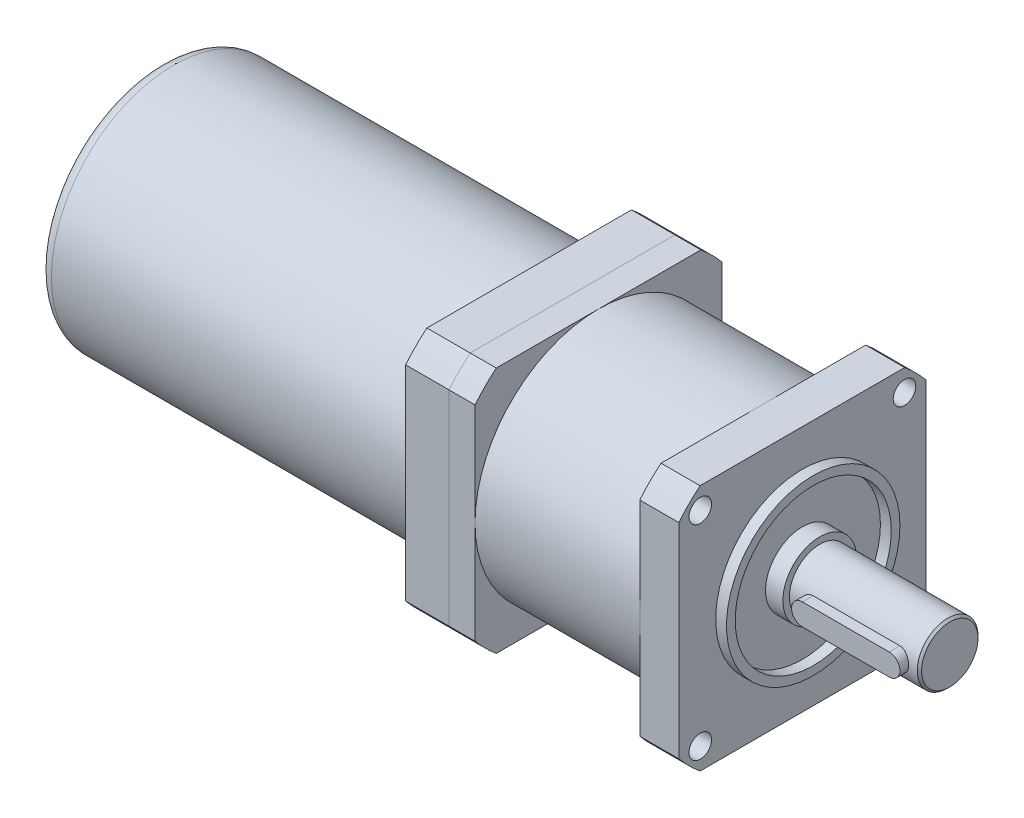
ISO-10303-21;
HEADER;
FILE_DESCRIPTION(('STEP AP214'),'2;1');
FILE_NAME('part.step','',(''),(''),'','','');
FILE_SCHEMA(('AUTOMOTIVE_DESIGN { 1 0 10303 214 1 1 1 1 }'));
ENDSEC;
DATA;
#1=APPLICATION_CONTEXT('core data for automotive mechanical design processes');
#2=APPLICATION_PROTOCOL_DEFINITION('international standard','automotive_design',2000,#1);
#3=PRODUCT_CONTEXT('',#1,'mechanical');
#4=PRODUCT('Part','Part','',(#3));
#5=PRODUCT_RELATED_PRODUCT_CATEGORY('part','',(#4));
#6=PRODUCT_DEFINITION_FORMATION('','',#4);
#7=PRODUCT_DEFINITION_CONTEXT('part definition',#1,'design');
#8=PRODUCT_DEFINITION('design','',#6,#7);
#9=PRODUCT_DEFINITION_SHAPE('','',#8);
#10=(LENGTH_UNIT() NAMED_UNIT(*) SI_UNIT(.MILLI.,.METRE.));
#11=(NAMED_UNIT(*) PLANE_ANGLE_UNIT() SI_UNIT($,.RADIAN.));
#12=(NAMED_UNIT(*) SI_UNIT($,.STERADIAN.) SOLID_ANGLE_UNIT());
#13=UNCERTAINTY_MEASURE_WITH_UNIT(LENGTH_MEASURE(1.E-05),#10,'distance_accuracy_value','');
#14=(GEOMETRIC_REPRESENTATION_CONTEXT(3) GLOBAL_UNCERTAINTY_ASSIGNED_CONTEXT((#13)) GLOBAL_UNIT_ASSIGNED_CONTEXT((#10,
#11,#12)) REPRESENTATION_CONTEXT('',''));
#15=CARTESIAN_POINT('',(0.,0.,0.));
#16=DIRECTION('',(0.,0.,1.));
#17=DIRECTION('',(1.,0.,0.));
#18=AXIS2_PLACEMENT_3D('',#15,#16,#17);
#19=CARTESIAN_POINT('',(-63.,0.,0.));
#20=DIRECTION('',(-1.,0.,0.));
#21=DIRECTION('',(0.,0.,1.));
#22=AXIS2_PLACEMENT_3D('',#19,#20,#21);
#23=PLANE('',#22);
#24=CARTESIAN_POINT('',(-63.,0.,0.));
#25=DIRECTION('',(-1.,0.,0.));
#26=DIRECTION('',(0.,0.,1.));
#27=AXIS2_PLACEMENT_3D('',#24,#25,#26);
#28=CIRCLE('',#27,37.);
#29=CARTESIAN_POINT('',(-63.,28.5,-23.5955504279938));
#30=VERTEX_POINT('',#29);
#31=CARTESIAN_POINT('',(-63.,23.5955504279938,-28.5));
#32=VERTEX_POINT('',#31);
#33=EDGE_CURVE('E158',#30,#32,#28,.T.);
#34=ORIENTED_EDGE('',*,*,#33,.T.);
#35=DIRECTION('',(0.,-1.,0.));
#36=VECTOR('',#35,1.);
#37=CARTESIAN_POINT('',(-63.,-23.5955504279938,-28.5));
#38=LINE('',#37,#36);
#39=CARTESIAN_POINT('',(-63.,-23.5955504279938,-28.5));
#40=VERTEX_POINT('',#39);
#41=EDGE_CURVE('E106',#32,#40,#38,.T.);
#42=ORIENTED_EDGE('',*,*,#41,.T.);
#43=CARTESIAN_POINT('',(-63.,0.,0.));
#44=DIRECTION('',(-1.,0.,0.));
#45=DIRECTION('',(0.,0.,1.));
#46=AXIS2_PLACEMENT_3D('',#43,#44,#45);
#47=CIRCLE('',#46,37.);
#48=CARTESIAN_POINT('',(-63.,-28.5,-23.5955504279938));
#49=VERTEX_POINT('',#48);
#50=EDGE_CURVE('E226',#40,#49,#47,.T.);
#51=ORIENTED_EDGE('',*,*,#50,.T.);
#52=DIRECTION('',(0.,0.,1.));
#53=VECTOR('',#52,1.);
#54=CARTESIAN_POINT('',(-63.,-28.5,-23.5955504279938));
#55=LINE('',#54,#53);
#56=CARTESIAN_POINT('',(-63.,-28.5,23.5955504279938));
#57=VERTEX_POINT('',#56);
#58=EDGE_CURVE('E231',#49,#57,#55,.T.);
#59=ORIENTED_EDGE('',*,*,#58,.T.);
#60=CARTESIAN_POINT('',(-63.,0.,0.));
#61=DIRECTION('',(-1.,0.,0.));
#62=DIRECTION('',(0.,0.,1.));
#63=AXIS2_PLACEMENT_3D('',#60,#61,#62);
#64=CIRCLE('',#63,37.);
#65=CARTESIAN_POINT('',(-63.,-23.5955504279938,28.5));
#66=VERTEX_POINT('',#65);
#67=EDGE_CURVE('E125',#57,#66,#64,.T.);
#68=ORIENTED_EDGE('',*,*,#67,.T.);
#69=DIRECTION('',(0.,1.,0.));
#70=VECTOR('',#69,1.);
#71=CARTESIAN_POINT('',(-63.,-23.5955504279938,28.5));
#72=LINE('',#71,#70);
#73=CARTESIAN_POINT('',(-63.,23.5955504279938,28.5));
#74=VERTEX_POINT('',#73);
#75=EDGE_CURVE('E119',#66,#74,#72,.T.);
#76=ORIENTED_EDGE('',*,*,#75,.T.);
#77=CARTESIAN_POINT('',(-63.,0.,0.));
#78=DIRECTION('',(-1.,0.,0.));
#79=DIRECTION('',(0.,0.,1.));
#80=AXIS2_PLACEMENT_3D('',#77,#78,#79);
#81=CIRCLE('',#80,37.);
#82=CARTESIAN_POINT('',(-63.,28.5,23.5955504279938));
#83=VERTEX_POINT('',#82);
#84=EDGE_CURVE('E123',#74,#83,#81,.T.);
#85=ORIENTED_EDGE('',*,*,#84,.T.);
#86=DIRECTION('',(0.,0.,-1.));
#87=VECTOR('',#86,1.);
#88=CARTESIAN_POINT('',(-63.,28.5,-23.5955504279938));
#89=LINE('',#88,#87);
#90=EDGE_CURVE('E62',#83,#30,#89,.T.);
#91=ORIENTED_EDGE('',*,*,#90,.T.);
#92=EDGE_LOOP('',(#34,#42,#51,#59,#68,#76,#85,#91));
#93=FACE_BOUND('',#92,.T.);
#94=CARTESIAN_POINT('',(-63.,0.,0.));
#95=DIRECTION('',(-1.,0.,0.));
#96=DIRECTION('',(0.,0.,1.));
#97=AXIS2_PLACEMENT_3D('',#94,#95,#96);
#98=CIRCLE('',#97,28.2);
#99=CARTESIAN_POINT('',(-63.,0.,28.2));
#100=VERTEX_POINT('',#99);
#101=EDGE_CURVE('E147',#100,#100,#98,.T.);
#102=ORIENTED_EDGE('',*,*,#101,.F.);
#103=EDGE_LOOP('',(#102));
#104=FACE_BOUND('',#103,.T.);
#105=ADVANCED_FACE('F45',(#93,#104),#23,.T.);
#106=CARTESIAN_POINT('',(-63.,0.,0.));
#107=DIRECTION('',(1.,0.,0.));
#108=DIRECTION('',(0.,0.,-1.));
#109=AXIS2_PLACEMENT_3D('',#106,#107,#108);
#110=CYLINDRICAL_SURFACE('',#109,37.);
#111=CARTESIAN_POINT('',(-53.,0.,0.));
#112=DIRECTION('',(-1.,0.,0.));
#113=DIRECTION('',(0.,0.,1.));
#114=AXIS2_PLACEMENT_3D('',#111,#112,#113);
#115=CIRCLE('',#114,37.);
#116=CARTESIAN_POINT('',(-53.,28.5,-23.5955504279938));
#117=VERTEX_POINT('',#116);
#118=CARTESIAN_POINT('',(-53.,23.5955504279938,-28.5));
#119=VERTEX_POINT('',#118);
#120=EDGE_CURVE('E143',#117,#119,#115,.T.);
#121=ORIENTED_EDGE('',*,*,#120,.T.);
#122=DIRECTION('',(1.,0.,0.));
#123=VECTOR('',#122,1.);
#124=CARTESIAN_POINT('',(-63.,23.5955504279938,-28.5));
#125=LINE('',#124,#123);
#126=EDGE_CURVE('E171',#32,#119,#125,.T.);
#127=ORIENTED_EDGE('',*,*,#126,.F.);
#128=ORIENTED_EDGE('',*,*,#33,.F.);
#129=DIRECTION('',(1.,0.,0.));
#130=VECTOR('',#129,1.);
#131=CARTESIAN_POINT('',(-63.,28.5,-23.5955504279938));
#132=LINE('',#131,#130);
#133=EDGE_CURVE('E139',#30,#117,#132,.T.);
#134=ORIENTED_EDGE('',*,*,#133,.T.);
#135=EDGE_LOOP('',(#121,#127,#128,#134));
#136=FACE_BOUND('',#135,.T.);
#137=ADVANCED_FACE('F186',(#136),#110,.T.);
#138=CARTESIAN_POINT('',(-63.,-23.5955504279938,-28.5));
#139=DIRECTION('',(0.,0.,1.));
#140=DIRECTION('',(1.,0.,0.));
#141=AXIS2_PLACEMENT_3D('',#138,#139,#140);
#142=PLANE('',#141);
#143=DIRECTION('',(0.,-1.,0.));
#144=VECTOR('',#143,1.);
#145=CARTESIAN_POINT('',(-53.,-23.5955504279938,-28.5));
#146=LINE('',#145,#144);
#147=CARTESIAN_POINT('',(-53.,-23.5955504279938,-28.5));
#148=VERTEX_POINT('',#147);
#149=EDGE_CURVE('E146',#119,#148,#146,.T.);
#150=ORIENTED_EDGE('',*,*,#149,.T.);
#151=DIRECTION('',(1.,0.,0.));
#152=VECTOR('',#151,1.);
#153=CARTESIAN_POINT('',(-63.,-23.5955504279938,-28.5));
#154=LINE('',#153,#152);
#155=EDGE_CURVE('E168',#40,#148,#154,.T.);
#156=ORIENTED_EDGE('',*,*,#155,.F.);
#157=ORIENTED_EDGE('',*,*,#41,.F.);
#158=ORIENTED_EDGE('',*,*,#126,.T.);
#159=EDGE_LOOP('',(#150,#156,#157,#158));
#160=FACE_BOUND('',#159,.T.);
#161=ADVANCED_FACE('F191',(#160),#142,.F.);
#162=CARTESIAN_POINT('',(-63.,0.,0.));
#163=DIRECTION('',(1.,0.,0.));
#164=DIRECTION('',(0.,0.,-1.));
#165=AXIS2_PLACEMENT_3D('',#162,#163,#164);
#166=CYLINDRICAL_SURFACE('',#165,37.);
#167=CARTESIAN_POINT('',(-53.,0.,0.));
#168=DIRECTION('',(-1.,0.,0.));
#169=DIRECTION('',(0.,0.,1.));
#170=AXIS2_PLACEMENT_3D('',#167,#168,#169);
#171=CIRCLE('',#170,37.);
#172=CARTESIAN_POINT('',(-53.,-28.5,-23.5955504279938));
#173=VERTEX_POINT('',#172);
#174=EDGE_CURVE('E149',#148,#173,#171,.T.);
#175=ORIENTED_EDGE('',*,*,#174,.T.);
#176=DIRECTION('',(1.,0.,0.));
#177=VECTOR('',#176,1.);
#178=CARTESIAN_POINT('',(-63.,-28.5,-23.5955504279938));
#179=LINE('',#178,#177);
#180=EDGE_CURVE('E165',#49,#173,#179,.T.);
#181=ORIENTED_EDGE('',*,*,#180,.F.);
#182=ORIENTED_EDGE('',*,*,#50,.F.);
#183=ORIENTED_EDGE('',*,*,#155,.T.);
#184=EDGE_LOOP('',(#175,#181,#182,#183));
#185=FACE_BOUND('',#184,.T.);
#186=ADVANCED_FACE('F213',(#185),#166,.T.);
#187=CARTESIAN_POINT('',(-63.,-28.5,-23.5955504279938));
#188=DIRECTION('',(0.,1.,0.));
#189=DIRECTION('',(0.,0.,1.));
#190=AXIS2_PLACEMENT_3D('',#187,#188,#189);
#191=PLANE('',#190);
#192=DIRECTION('',(0.,0.,1.));
#193=VECTOR('',#192,1.);
#194=CARTESIAN_POINT('',(-53.,-28.5,-23.5955504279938));
#195=LINE('',#194,#193);
#196=CARTESIAN_POINT('',(-53.,-28.5,23.5955504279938));
#197=VERTEX_POINT('',#196);
#198=EDGE_CURVE('E151',#173,#197,#195,.T.);
#199=ORIENTED_EDGE('',*,*,#198,.T.);
#200=DIRECTION('',(1.,0.,0.));
#201=VECTOR('',#200,1.);
#202=CARTESIAN_POINT('',(-63.,-28.5,23.5955504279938));
#203=LINE('',#202,#201);
#204=EDGE_CURVE('E162',#57,#197,#203,.T.);
#205=ORIENTED_EDGE('',*,*,#204,.F.);
#206=ORIENTED_EDGE('',*,*,#58,.F.);
#207=ORIENTED_EDGE('',*,*,#180,.T.);
#208=EDGE_LOOP('',(#199,#205,#206,#207));
#209=FACE_BOUND('',#208,.T.);
#210=ADVANCED_FACE('F209',(#209),#191,.F.);
#211=CARTESIAN_POINT('',(-63.,0.,0.));
#212=DIRECTION('',(1.,0.,0.));
#213=DIRECTION('',(0.,0.,-1.));
#214=AXIS2_PLACEMENT_3D('',#211,#212,#213);
#215=CYLINDRICAL_SURFACE('',#214,37.);
#216=CARTESIAN_POINT('',(-53.,0.,0.));
#217=DIRECTION('',(-1.,0.,0.));
#218=DIRECTION('',(0.,0.,1.));
#219=AXIS2_PLACEMENT_3D('',#216,#217,#218);
#220=CIRCLE('',#219,37.);
#221=CARTESIAN_POINT('',(-53.,-23.5955504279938,28.5));
#222=VERTEX_POINT('',#221);
#223=EDGE_CURVE('E153',#197,#222,#220,.T.);
#224=ORIENTED_EDGE('',*,*,#223,.T.);
#225=DIRECTION('',(1.,0.,0.));
#226=VECTOR('',#225,1.);
#227=CARTESIAN_POINT('',(-63.,-23.5955504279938,28.5));
#228=LINE('',#227,#226);
#229=EDGE_CURVE('E134',#66,#222,#228,.T.);
#230=ORIENTED_EDGE('',*,*,#229,.F.);
#231=ORIENTED_EDGE('',*,*,#67,.F.);
#232=ORIENTED_EDGE('',*,*,#204,.T.);
#233=EDGE_LOOP('',(#224,#230,#231,#232));
#234=FACE_BOUND('',#233,.T.);
#235=ADVANCED_FACE('F206',(#234),#215,.T.);
#236=CARTESIAN_POINT('',(-63.,-23.5955504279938,28.5));
#237=DIRECTION('',(0.,0.,-1.));
#238=DIRECTION('',(-1.,0.,0.));
#239=AXIS2_PLACEMENT_3D('',#236,#237,#238);
#240=PLANE('',#239);
#241=DIRECTION('',(0.,1.,0.));
#242=VECTOR('',#241,1.);
#243=CARTESIAN_POINT('',(-53.,-23.5955504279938,28.5));
#244=LINE('',#243,#242);
#245=CARTESIAN_POINT('',(-53.,23.5955504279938,28.5));
#246=VERTEX_POINT('',#245);
#247=EDGE_CURVE('E133',#222,#246,#244,.T.);
#248=ORIENTED_EDGE('',*,*,#247,.T.);
#249=DIRECTION('',(1.,0.,0.));
#250=VECTOR('',#249,1.);
#251=CARTESIAN_POINT('',(-63.,23.5955504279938,28.5));
#252=LINE('',#251,#250);
#253=EDGE_CURVE('E130',#74,#246,#252,.T.);
#254=ORIENTED_EDGE('',*,*,#253,.F.);
#255=ORIENTED_EDGE('',*,*,#75,.F.);
#256=ORIENTED_EDGE('',*,*,#229,.T.);
#257=EDGE_LOOP('',(#248,#254,#255,#256));
#258=FACE_BOUND('',#257,.T.);
#259=ADVANCED_FACE('F131',(#258),#240,.F.);
#260=CARTESIAN_POINT('',(-63.,0.,0.));
#261=DIRECTION('',(1.,0.,0.));
#262=DIRECTION('',(0.,0.,-1.));
#263=AXIS2_PLACEMENT_3D('',#260,#261,#262);
#264=CYLINDRICAL_SURFACE('',#263,37.);
#265=CARTESIAN_POINT('',(-53.,0.,0.));
#266=DIRECTION('',(-1.,0.,0.));
#267=DIRECTION('',(0.,0.,1.));
#268=AXIS2_PLACEMENT_3D('',#265,#266,#267);
#269=CIRCLE('',#268,37.);
#270=CARTESIAN_POINT('',(-53.,28.5,23.5955504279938));
#271=VERTEX_POINT('',#270);
#272=EDGE_CURVE('E91',#246,#271,#269,.T.);
#273=ORIENTED_EDGE('',*,*,#272,.T.);
#274=DIRECTION('',(1.,0.,0.));
#275=VECTOR('',#274,1.);
#276=CARTESIAN_POINT('',(-63.,28.5,23.5955504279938));
#277=LINE('',#276,#275);
#278=EDGE_CURVE('E135',#83,#271,#277,.T.);
#279=ORIENTED_EDGE('',*,*,#278,.F.);
#280=ORIENTED_EDGE('',*,*,#84,.F.);
#281=ORIENTED_EDGE('',*,*,#253,.T.);
#282=EDGE_LOOP('',(#273,#279,#280,#281));
#283=FACE_BOUND('',#282,.T.);
#284=ADVANCED_FACE('F137',(#283),#264,.T.);
#285=CARTESIAN_POINT('',(-63.,28.5,-23.5955504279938));
#286=DIRECTION('',(0.,-1.,0.));
#287=DIRECTION('',(0.,0.,-1.));
#288=AXIS2_PLACEMENT_3D('',#285,#286,#287);
#289=PLANE('',#288);
#290=DIRECTION('',(0.,0.,-1.));
#291=VECTOR('',#290,1.);
#292=CARTESIAN_POINT('',(-53.,28.5,-23.5955504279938));
#293=LINE('',#292,#291);
#294=EDGE_CURVE('E97',#271,#117,#293,.T.);
#295=ORIENTED_EDGE('',*,*,#294,.T.);
#296=ORIENTED_EDGE('',*,*,#133,.F.);
#297=ORIENTED_EDGE('',*,*,#90,.F.);
#298=ORIENTED_EDGE('',*,*,#278,.T.);
#299=EDGE_LOOP('',(#295,#296,#297,#298));
#300=FACE_BOUND('',#299,.T.);
#301=ADVANCED_FACE('F198',(#300),#289,.F.);
#302=CARTESIAN_POINT('',(-53.,0.,0.));
#303=DIRECTION('',(-1.,0.,0.));
#304=DIRECTION('',(0.,0.,1.));
#305=AXIS2_PLACEMENT_3D('',#302,#303,#304);
#306=PLANE('',#305);
#307=ORIENTED_EDGE('',*,*,#120,.F.);
#308=ORIENTED_EDGE('',*,*,#294,.F.);
#309=ORIENTED_EDGE('',*,*,#272,.F.);
#310=ORIENTED_EDGE('',*,*,#247,.F.);
#311=ORIENTED_EDGE('',*,*,#223,.F.);
#312=ORIENTED_EDGE('',*,*,#198,.F.);
#313=ORIENTED_EDGE('',*,*,#174,.F.);
#314=ORIENTED_EDGE('',*,*,#149,.F.);
#315=EDGE_LOOP('',(#307,#308,#309,#310,#311,#312,#313,#314));
#316=FACE_BOUND('',#315,.T.);
#317=ADVANCED_FACE('F195',(#316),#306,.F.);
#318=CARTESIAN_POINT('',(-148.,0.,0.));
#319=DIRECTION('',(1.,0.,0.));
#320=DIRECTION('',(0.,0.,-1.));
#321=AXIS2_PLACEMENT_3D('',#318,#319,#320);
#322=CYLINDRICAL_SURFACE('',#321,28.2);
#323=CARTESIAN_POINT('',(-145.,0.,0.));
#324=DIRECTION('',(-1.,0.,0.));
#325=DIRECTION('',(0.,0.,1.));
#326=AXIS2_PLACEMENT_3D('',#323,#324,#325);
#327=CIRCLE('',#326,28.2);
#328=CARTESIAN_POINT('',(-145.,0.,28.2));
#329=VERTEX_POINT('',#328);
#330=EDGE_CURVE('E12',#329,#329,#327,.F.);
#331=ORIENTED_EDGE('',*,*,#330,.T.);
#332=EDGE_LOOP('',(#331));
#333=FACE_BOUND('',#332,.T.);
#334=ORIENTED_EDGE('',*,*,#101,.T.);
#335=EDGE_LOOP('',(#334));
#336=FACE_BOUND('',#335,.T.);
#337=ADVANCED_FACE('F182',(#333,#336),#322,.T.);
#338=CARTESIAN_POINT('',(-148.,0.,0.));
#339=DIRECTION('',(-1.,0.,0.));
#340=DIRECTION('',(0.,0.,1.));
#341=AXIS2_PLACEMENT_3D('',#338,#339,#340);
#342=PLANE('',#341);
#343=CARTESIAN_POINT('',(-148.,0.,0.));
#344=DIRECTION('',(-1.,0.,0.));
#345=DIRECTION('',(0.,0.,1.));
#346=AXIS2_PLACEMENT_3D('',#343,#344,#345);
#347=CIRCLE('',#346,25.2);
#348=CARTESIAN_POINT('',(-148.,0.,25.2));
#349=VERTEX_POINT('',#348);
#350=EDGE_CURVE('E54',#349,#349,#347,.T.);
#351=ORIENTED_EDGE('',*,*,#350,.T.);
#352=EDGE_LOOP('',(#351));
#353=FACE_BOUND('',#352,.T.);
#354=ADVANCED_FACE('F175',(#353),#342,.T.);
#355=CARTESIAN_POINT('',(-145.,0.,0.));
#356=DIRECTION('',(-1.,0.,0.));
#357=DIRECTION('',(0.,0.,1.));
#358=AXIS2_PLACEMENT_3D('',#355,#356,#357);
#359=TOROIDAL_SURFACE('',#358,25.2,3.);
#360=ORIENTED_EDGE('',*,*,#330,.F.);
#361=EDGE_LOOP('',(#360));
#362=FACE_BOUND('',#361,.T.);
#363=ORIENTED_EDGE('',*,*,#350,.F.);
#364=EDGE_LOOP('',(#363));
#365=FACE_BOUND('',#364,.T.);
#366=ADVANCED_FACE('F47',(#362,#365),#359,.T.);
#367=CLOSED_SHELL('',(#105,#137,#161,#186,#210,#235,#259,#284,#301,#317,#337,#354,#366));
#368=MANIFOLD_SOLID_BREP('B2',#367);
#369=CARTESIAN_POINT('',(4.,0.,0.));
#370=DIRECTION('',(1.,0.,0.));
#371=DIRECTION('',(0.,0.,-1.));
#372=AXIS2_PLACEMENT_3D('',#369,#370,#371);
#373=PLANE('',#372);
#374=CARTESIAN_POINT('',(4.,0.,0.));
#375=DIRECTION('',(1.,0.,0.));
#376=DIRECTION('',(0.,0.,-1.));
#377=AXIS2_PLACEMENT_3D('',#374,#375,#376);
#378=CIRCLE('',#377,8.5);
#379=CARTESIAN_POINT('',(4.,0.,-8.5));
#380=VERTEX_POINT('',#379);
#381=EDGE_CURVE('E510',#380,#380,#378,.T.);
#382=ORIENTED_EDGE('',*,*,#381,.T.);
#383=EDGE_LOOP('',(#382));
#384=FACE_BOUND('',#383,.T.);
#385=CARTESIAN_POINT('',(4.,0.,0.));
#386=DIRECTION('',(1.,0.,0.));
#387=DIRECTION('',(0.,0.,-1.));
#388=AXIS2_PLACEMENT_3D('',#385,#386,#387);
#389=CIRCLE('',#388,7.);
#390=CARTESIAN_POINT('',(4.,0.,-7.));
#391=VERTEX_POINT('',#390);
#392=EDGE_CURVE('E501',#391,#391,#389,.T.);
#393=ORIENTED_EDGE('',*,*,#392,.F.);
#394=EDGE_LOOP('',(#393));
#395=FACE_BOUND('',#394,.T.);
#396=ADVANCED_FACE('F318',(#384,#395),#373,.T.);
#397=CARTESIAN_POINT('',(0.,0.,0.));
#398=DIRECTION('',(1.,0.,0.));
#399=DIRECTION('',(0.,0.,-1.));
#400=AXIS2_PLACEMENT_3D('',#397,#398,#399);
#401=PLANE('',#400);
#402=CARTESIAN_POINT('',(0.,0.,0.));
#403=DIRECTION('',(1.,0.,0.));
#404=DIRECTION('',(0.,0.,-1.));
#405=AXIS2_PLACEMENT_3D('',#402,#403,#404);
#406=CIRCLE('',#405,18.);
#407=CARTESIAN_POINT('',(0.,0.,-18.));
#408=VERTEX_POINT('',#407);
#409=EDGE_CURVE('E690',#408,#408,#406,.F.);
#410=ORIENTED_EDGE('',*,*,#409,.F.);
#411=EDGE_LOOP('',(#410));
#412=FACE_BOUND('',#411,.T.);
#413=CARTESIAN_POINT('',(0.,0.,0.));
#414=DIRECTION('',(1.,0.,0.));
#415=DIRECTION('',(0.,0.,-1.));
#416=AXIS2_PLACEMENT_3D('',#413,#414,#415);
#417=CIRCLE('',#416,8.5);
#418=CARTESIAN_POINT('',(0.,0.,-8.5));
#419=VERTEX_POINT('',#418);
#420=EDGE_CURVE('E504',#419,#419,#417,.T.);
#421=ORIENTED_EDGE('',*,*,#420,.F.);
#422=EDGE_LOOP('',(#421));
#423=FACE_BOUND('',#422,.T.);
#424=ADVANCED_FACE('F725',(#412,#423),#401,.T.);
#425=CARTESIAN_POINT('',(0.,-23.55,23.55));
#426=DIRECTION('',(1.,0.,0.));
#427=DIRECTION('',(0.,0.,-1.));
#428=AXIS2_PLACEMENT_3D('',#425,#426,#427);
#429=CIRCLE('',#428,2.6);
#430=CARTESIAN_POINT('',(0.,-23.55,20.95));
#431=VERTEX_POINT('',#430);
#432=EDGE_CURVE('E522',#431,#431,#429,.T.);
#433=ORIENTED_EDGE('',*,*,#432,.F.);
#434=EDGE_LOOP('',(#433));
#435=FACE_BOUND('',#434,.T.);
#436=CARTESIAN_POINT('',(0.,-23.55,-23.55));
#437=DIRECTION('',(1.,0.,0.));
#438=DIRECTION('',(0.,0.,-1.));
#439=AXIS2_PLACEMENT_3D('',#436,#437,#438);
#440=CIRCLE('',#439,2.6);
#441=CARTESIAN_POINT('',(0.,-23.55,-26.15));
#442=VERTEX_POINT('',#441);
#443=EDGE_CURVE('E528',#442,#442,#440,.T.);
#444=ORIENTED_EDGE('',*,*,#443,.F.);
#445=EDGE_LOOP('',(#444));
#446=FACE_BOUND('',#445,.T.);
#447=CARTESIAN_POINT('',(0.,23.55,-23.55));
#448=DIRECTION('',(1.,0.,0.));
#449=DIRECTION('',(0.,0.,-1.));
#450=AXIS2_PLACEMENT_3D('',#447,#448,#449);
#451=CIRCLE('',#450,2.6);
#452=CARTESIAN_POINT('',(0.,23.55,-26.15));
#453=VERTEX_POINT('',#452);
#454=EDGE_CURVE('E534',#453,#453,#451,.T.);
#455=ORIENTED_EDGE('',*,*,#454,.F.);
#456=EDGE_LOOP('',(#455));
#457=FACE_BOUND('',#456,.T.);
#458=CARTESIAN_POINT('',(0.,23.55,23.55));
#459=DIRECTION('',(1.,0.,0.));
#460=DIRECTION('',(0.,0.,-1.));
#461=AXIS2_PLACEMENT_3D('',#458,#459,#460);
#462=CIRCLE('',#461,2.6);
#463=CARTESIAN_POINT('',(0.,23.55,20.95));
#464=VERTEX_POINT('',#463);
#465=EDGE_CURVE('E540',#464,#464,#462,.T.);
#466=ORIENTED_EDGE('',*,*,#465,.F.);
#467=EDGE_LOOP('',(#466));
#468=FACE_BOUND('',#467,.T.);
#469=CARTESIAN_POINT('',(0.,0.,0.));
#470=DIRECTION('',(1.,0.,0.));
#471=DIRECTION('',(0.,0.,-1.));
#472=AXIS2_PLACEMENT_3D('',#469,#470,#471);
#473=CIRCLE('',#472,37.);
#474=CARTESIAN_POINT('',(0.,23.5955504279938,-28.5));
#475=VERTEX_POINT('',#474);
#476=CARTESIAN_POINT('',(0.,28.5,-23.5955504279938));
#477=VERTEX_POINT('',#476);
#478=EDGE_CURVE('E618',#475,#477,#473,.T.);
#479=ORIENTED_EDGE('',*,*,#478,.T.);
#480=DIRECTION('',(0.,0.,1.));
#481=VECTOR('',#480,1.);
#482=CARTESIAN_POINT('',(0.,28.5,23.5955504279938));
#483=LINE('',#482,#481);
#484=CARTESIAN_POINT('',(0.,28.5,23.5955504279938));
#485=VERTEX_POINT('',#484);
#486=EDGE_CURVE('E655',#477,#485,#483,.T.);
#487=ORIENTED_EDGE('',*,*,#486,.T.);
#488=CARTESIAN_POINT('',(0.,0.,0.));
#489=DIRECTION('',(1.,0.,0.));
#490=DIRECTION('',(0.,0.,-1.));
#491=AXIS2_PLACEMENT_3D('',#488,#489,#490);
#492=CIRCLE('',#491,37.);
#493=CARTESIAN_POINT('',(0.,23.5955504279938,28.5));
#494=VERTEX_POINT('',#493);
#495=EDGE_CURVE('E658',#485,#494,#492,.T.);
#496=ORIENTED_EDGE('',*,*,#495,.T.);
#497=DIRECTION('',(0.,-1.,0.));
#498=VECTOR('',#497,1.);
#499=CARTESIAN_POINT('',(0.,-23.5955504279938,28.5));
#500=LINE('',#499,#498);
#501=CARTESIAN_POINT('',(0.,-23.5955504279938,28.5));
#502=VERTEX_POINT('',#501);
#503=EDGE_CURVE('E661',#494,#502,#500,.T.);
#504=ORIENTED_EDGE('',*,*,#503,.T.);
#505=CARTESIAN_POINT('',(0.,0.,0.));
#506=DIRECTION('',(1.,0.,0.));
#507=DIRECTION('',(0.,0.,-1.));
#508=AXIS2_PLACEMENT_3D('',#505,#506,#507);
#509=CIRCLE('',#508,37.);
#510=CARTESIAN_POINT('',(0.,-28.5,23.5955504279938));
#511=VERTEX_POINT('',#510);
#512=EDGE_CURVE('E664',#502,#511,#509,.T.);
#513=ORIENTED_EDGE('',*,*,#512,.T.);
#514=DIRECTION('',(0.,0.,-1.));
#515=VECTOR('',#514,1.);
#516=CARTESIAN_POINT('',(0.,-28.5,23.5955504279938));
#517=LINE('',#516,#515);
#518=CARTESIAN_POINT('',(0.,-28.5,-23.5955504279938));
#519=VERTEX_POINT('',#518);
#520=EDGE_CURVE('E667',#511,#519,#517,.T.);
#521=ORIENTED_EDGE('',*,*,#520,.T.);
#522=CARTESIAN_POINT('',(0.,0.,0.));
#523=DIRECTION('',(1.,0.,0.));
#524=DIRECTION('',(0.,0.,-1.));
#525=AXIS2_PLACEMENT_3D('',#522,#523,#524);
#526=CIRCLE('',#525,37.);
#527=CARTESIAN_POINT('',(0.,-23.5955504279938,-28.5));
#528=VERTEX_POINT('',#527);
#529=EDGE_CURVE('E670',#519,#528,#526,.T.);
#530=ORIENTED_EDGE('',*,*,#529,.T.);
#531=DIRECTION('',(0.,1.,0.));
#532=VECTOR('',#531,1.);
#533=CARTESIAN_POINT('',(0.,-23.5955504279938,-28.5));
#534=LINE('',#533,#532);
#535=EDGE_CURVE('E628',#528,#475,#534,.T.);
#536=ORIENTED_EDGE('',*,*,#535,.T.);
#537=EDGE_LOOP('',(#479,#487,#496,#504,#513,#521,#530,#536));
#538=FACE_BOUND('',#537,.T.);
#539=CARTESIAN_POINT('',(0.,0.,0.));
#540=DIRECTION('',(1.,0.,0.));
#541=DIRECTION('',(0.,0.,-1.));
#542=AXIS2_PLACEMENT_3D('',#539,#540,#541);
#543=CIRCLE('',#542,20.);
#544=CARTESIAN_POINT('',(0.,0.,-20.));
#545=VERTEX_POINT('',#544);
#546=EDGE_CURVE('E518',#545,#545,#543,.T.);
#547=ORIENTED_EDGE('',*,*,#546,.F.);
#548=EDGE_LOOP('',(#547));
#549=FACE_BOUND('',#548,.T.);
#550=ADVANCED_FACE('F730',(#435,#446,#457,#468,#538,#549),#401,.T.);
#551=CARTESIAN_POINT('',(-9.,0.,0.));
#552=DIRECTION('',(1.,0.,0.));
#553=DIRECTION('',(0.,0.,-1.));
#554=AXIS2_PLACEMENT_3D('',#551,#552,#553);
#555=PLANE('',#554);
#556=CARTESIAN_POINT('',(-9.,23.55,23.55));
#557=DIRECTION('',(1.,0.,0.));
#558=DIRECTION('',(0.,0.,-1.));
#559=AXIS2_PLACEMENT_3D('',#556,#557,#558);
#560=CIRCLE('',#559,2.6);
#561=CARTESIAN_POINT('',(-9.,23.55,20.95));
#562=VERTEX_POINT('',#561);
#563=EDGE_CURVE('E543',#562,#562,#560,.T.);
#564=ORIENTED_EDGE('',*,*,#563,.T.);
#565=EDGE_LOOP('',(#564));
#566=FACE_BOUND('',#565,.T.);
#567=CARTESIAN_POINT('',(-9.,0.,0.));
#568=DIRECTION('',(-1.,0.,0.));
#569=DIRECTION('',(0.,0.,1.));
#570=AXIS2_PLACEMENT_3D('',#567,#568,#569);
#571=CIRCLE('',#570,28.5);
#572=CARTESIAN_POINT('',(-9.,0.,28.5));
#573=VERTEX_POINT('',#572);
#574=CARTESIAN_POINT('',(-9.,28.5,0.));
#575=VERTEX_POINT('',#574);
#576=EDGE_CURVE('E614',#573,#575,#571,.T.);
#577=ORIENTED_EDGE('',*,*,#576,.F.);
#578=DIRECTION('',(0.,-1.,0.));
#579=VECTOR('',#578,1.);
#580=CARTESIAN_POINT('',(-9.,-23.5955504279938,28.5));
#581=LINE('',#580,#579);
#582=CARTESIAN_POINT('',(-9.,23.5955504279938,28.5));
#583=VERTEX_POINT('',#582);
#584=EDGE_CURVE('E636',#583,#573,#581,.T.);
#585=ORIENTED_EDGE('',*,*,#584,.F.);
#586=CARTESIAN_POINT('',(-9.,0.,0.));
#587=DIRECTION('',(1.,0.,0.));
#588=DIRECTION('',(0.,0.,-1.));
#589=AXIS2_PLACEMENT_3D('',#586,#587,#588);
#590=CIRCLE('',#589,37.);
#591=CARTESIAN_POINT('',(-9.,28.5,23.5955504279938));
#592=VERTEX_POINT('',#591);
#593=EDGE_CURVE('E632',#592,#583,#590,.T.);
#594=ORIENTED_EDGE('',*,*,#593,.F.);
#595=DIRECTION('',(0.,0.,1.));
#596=VECTOR('',#595,1.);
#597=CARTESIAN_POINT('',(-9.,28.5,23.5955504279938));
#598=LINE('',#597,#596);
#599=EDGE_CURVE('E627',#575,#592,#598,.T.);
#600=ORIENTED_EDGE('',*,*,#599,.F.);
#601=EDGE_LOOP('',(#577,#585,#594,#600));
#602=FACE_BOUND('',#601,.T.);
#603=ADVANCED_FACE('F812',(#566,#602),#555,.F.);
#604=CARTESIAN_POINT('',(-9.,23.55,-23.55));
#605=DIRECTION('',(1.,0.,0.));
#606=DIRECTION('',(0.,0.,-1.));
#607=AXIS2_PLACEMENT_3D('',#604,#605,#606);
#608=CIRCLE('',#607,2.6);
#609=CARTESIAN_POINT('',(-9.,23.55,-26.15));
#610=VERTEX_POINT('',#609);
#611=EDGE_CURVE('E537',#610,#610,#608,.T.);
#612=ORIENTED_EDGE('',*,*,#611,.T.);
#613=EDGE_LOOP('',(#612));
#614=FACE_BOUND('',#613,.T.);
#615=CARTESIAN_POINT('',(-9.,0.,-28.5));
#616=VERTEX_POINT('',#615);
#617=EDGE_CURVE('E622',#575,#616,#571,.T.);
#618=ORIENTED_EDGE('',*,*,#617,.F.);
#619=CARTESIAN_POINT('',(-9.,28.5,-23.5955504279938));
#620=VERTEX_POINT('',#619);
#621=EDGE_CURVE('E629',#620,#575,#598,.T.);
#622=ORIENTED_EDGE('',*,*,#621,.F.);
#623=CARTESIAN_POINT('',(-9.,0.,0.));
#624=DIRECTION('',(1.,0.,0.));
#625=DIRECTION('',(0.,0.,-1.));
#626=AXIS2_PLACEMENT_3D('',#623,#624,#625);
#627=CIRCLE('',#626,37.);
#628=CARTESIAN_POINT('',(-9.,23.5955504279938,-28.5));
#629=VERTEX_POINT('',#628);
#630=EDGE_CURVE('E624',#629,#620,#627,.T.);
#631=ORIENTED_EDGE('',*,*,#630,.F.);
#632=DIRECTION('',(0.,1.,0.));
#633=VECTOR('',#632,1.);
#634=CARTESIAN_POINT('',(-9.,-23.5955504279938,-28.5));
#635=LINE('',#634,#633);
#636=EDGE_CURVE('E648',#616,#629,#635,.T.);
#637=ORIENTED_EDGE('',*,*,#636,.F.);
#638=EDGE_LOOP('',(#618,#622,#631,#637));
#639=FACE_BOUND('',#638,.T.);
#640=ADVANCED_FACE('F814',(#614,#639),#555,.F.);
#641=CARTESIAN_POINT('',(-9.,-23.55,-23.55));
#642=DIRECTION('',(1.,0.,0.));
#643=DIRECTION('',(0.,0.,-1.));
#644=AXIS2_PLACEMENT_3D('',#641,#642,#643);
#645=CIRCLE('',#644,2.6);
#646=CARTESIAN_POINT('',(-9.,-23.55,-26.15));
#647=VERTEX_POINT('',#646);
#648=EDGE_CURVE('E531',#647,#647,#645,.T.);
#649=ORIENTED_EDGE('',*,*,#648,.T.);
#650=EDGE_LOOP('',(#649));
#651=FACE_BOUND('',#650,.T.);
#652=CARTESIAN_POINT('',(-9.,-28.5,0.));
#653=VERTEX_POINT('',#652);
#654=EDGE_CURVE('E886',#616,#653,#571,.T.);
#655=ORIENTED_EDGE('',*,*,#654,.F.);
#656=CARTESIAN_POINT('',(-9.,-23.5955504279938,-28.5));
#657=VERTEX_POINT('',#656);
#658=EDGE_CURVE('E649',#657,#616,#635,.T.);
#659=ORIENTED_EDGE('',*,*,#658,.F.);
#660=CARTESIAN_POINT('',(-9.,0.,0.));
#661=DIRECTION('',(1.,0.,0.));
#662=DIRECTION('',(0.,0.,-1.));
#663=AXIS2_PLACEMENT_3D('',#660,#661,#662);
#664=CIRCLE('',#663,37.);
#665=CARTESIAN_POINT('',(-9.,-28.5,-23.5955504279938));
#666=VERTEX_POINT('',#665);
#667=EDGE_CURVE('E645',#666,#657,#664,.T.);
#668=ORIENTED_EDGE('',*,*,#667,.F.);
#669=DIRECTION('',(0.,0.,-1.));
#670=VECTOR('',#669,1.);
#671=CARTESIAN_POINT('',(-9.,-28.5,23.5955504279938));
#672=LINE('',#671,#670);
#673=EDGE_CURVE('E641',#653,#666,#672,.T.);
#674=ORIENTED_EDGE('',*,*,#673,.F.);
#675=EDGE_LOOP('',(#655,#659,#668,#674));
#676=FACE_BOUND('',#675,.T.);
#677=ADVANCED_FACE('F850',(#651,#676),#555,.F.);
#678=CARTESIAN_POINT('',(-9.,-23.55,23.55));
#679=DIRECTION('',(1.,0.,0.));
#680=DIRECTION('',(0.,0.,-1.));
#681=AXIS2_PLACEMENT_3D('',#678,#679,#680);
#682=CIRCLE('',#681,2.6);
#683=CARTESIAN_POINT('',(-9.,-23.55,20.95));
#684=VERTEX_POINT('',#683);
#685=EDGE_CURVE('E525',#684,#684,#682,.T.);
#686=ORIENTED_EDGE('',*,*,#685,.T.);
#687=EDGE_LOOP('',(#686));
#688=FACE_BOUND('',#687,.T.);
#689=EDGE_CURVE('E623',#653,#573,#571,.T.);
#690=ORIENTED_EDGE('',*,*,#689,.F.);
#691=CARTESIAN_POINT('',(-9.,-28.5,23.5955504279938));
#692=VERTEX_POINT('',#691);
#693=EDGE_CURVE('E642',#692,#653,#672,.T.);
#694=ORIENTED_EDGE('',*,*,#693,.F.);
#695=CARTESIAN_POINT('',(-9.,0.,0.));
#696=DIRECTION('',(1.,0.,0.));
#697=DIRECTION('',(0.,0.,-1.));
#698=AXIS2_PLACEMENT_3D('',#695,#696,#697);
#699=CIRCLE('',#698,37.);
#700=CARTESIAN_POINT('',(-9.,-23.5955504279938,28.5));
#701=VERTEX_POINT('',#700);
#702=EDGE_CURVE('E638',#701,#692,#699,.T.);
#703=ORIENTED_EDGE('',*,*,#702,.F.);
#704=EDGE_CURVE('E635',#573,#701,#581,.T.);
#705=ORIENTED_EDGE('',*,*,#704,.F.);
#706=EDGE_LOOP('',(#690,#694,#703,#705));
#707=FACE_BOUND('',#706,.T.);
#708=ADVANCED_FACE('F816',(#688,#707),#555,.F.);
#709=CARTESIAN_POINT('',(-9.,0.,0.));
#710=DIRECTION('',(1.,0.,0.));
#711=DIRECTION('',(0.,0.,-1.));
#712=AXIS2_PLACEMENT_3D('',#709,#710,#711);
#713=CYLINDRICAL_SURFACE('',#712,37.);
#714=ORIENTED_EDGE('',*,*,#478,.F.);
#715=DIRECTION('',(1.,0.,0.));
#716=VECTOR('',#715,1.);
#717=CARTESIAN_POINT('',(-9.,23.5955504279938,-28.5));
#718=LINE('',#717,#716);
#719=EDGE_CURVE('E675',#629,#475,#718,.T.);
#720=ORIENTED_EDGE('',*,*,#719,.F.);
#721=ORIENTED_EDGE('',*,*,#630,.T.);
#722=DIRECTION('',(1.,0.,0.));
#723=VECTOR('',#722,1.);
#724=CARTESIAN_POINT('',(-9.,28.5,-23.5955504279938));
#725=LINE('',#724,#723);
#726=EDGE_CURVE('E652',#620,#477,#725,.T.);
#727=ORIENTED_EDGE('',*,*,#726,.T.);
#728=EDGE_LOOP('',(#714,#720,#721,#727));
#729=FACE_BOUND('',#728,.T.);
#730=ADVANCED_FACE('F822',(#729),#713,.T.);
#731=CARTESIAN_POINT('',(-9.,-23.5955504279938,-28.5));
#732=DIRECTION('',(0.,0.,-1.));
#733=DIRECTION('',(-1.,0.,0.));
#734=AXIS2_PLACEMENT_3D('',#731,#732,#733);
#735=PLANE('',#734);
#736=ORIENTED_EDGE('',*,*,#535,.F.);
#737=DIRECTION('',(1.,0.,0.));
#738=VECTOR('',#737,1.);
#739=CARTESIAN_POINT('',(-9.,-23.5955504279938,-28.5));
#740=LINE('',#739,#738);
#741=EDGE_CURVE('E677',#657,#528,#740,.T.);
#742=ORIENTED_EDGE('',*,*,#741,.F.);
#743=ORIENTED_EDGE('',*,*,#658,.T.);
#744=ORIENTED_EDGE('',*,*,#636,.T.);
#745=ORIENTED_EDGE('',*,*,#719,.T.);
#746=EDGE_LOOP('',(#736,#742,#743,#744,#745));
#747=FACE_BOUND('',#746,.T.);
#748=ADVANCED_FACE('F818',(#747),#735,.T.);
#749=CARTESIAN_POINT('',(-9.,0.,0.));
#750=DIRECTION('',(1.,0.,0.));
#751=DIRECTION('',(0.,0.,-1.));
#752=AXIS2_PLACEMENT_3D('',#749,#750,#751);
#753=CYLINDRICAL_SURFACE('',#752,37.);
#754=ORIENTED_EDGE('',*,*,#529,.F.);
#755=DIRECTION('',(1.,0.,0.));
#756=VECTOR('',#755,1.);
#757=CARTESIAN_POINT('',(-9.,-28.5,-23.5955504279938));
#758=LINE('',#757,#756);
#759=EDGE_CURVE('E679',#666,#519,#758,.T.);
#760=ORIENTED_EDGE('',*,*,#759,.F.);
#761=ORIENTED_EDGE('',*,*,#667,.T.);
#762=ORIENTED_EDGE('',*,*,#741,.T.);
#763=EDGE_LOOP('',(#754,#760,#761,#762));
#764=FACE_BOUND('',#763,.T.);
#765=ADVANCED_FACE('F821',(#764),#753,.T.);
#766=CARTESIAN_POINT('',(-9.,-28.5,23.5955504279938));
#767=DIRECTION('',(0.,-1.,0.));
#768=DIRECTION('',(0.,0.,-1.));
#769=AXIS2_PLACEMENT_3D('',#766,#767,#768);
#770=PLANE('',#769);
#771=ORIENTED_EDGE('',*,*,#520,.F.);
#772=DIRECTION('',(1.,0.,0.));
#773=VECTOR('',#772,1.);
#774=CARTESIAN_POINT('',(-9.,-28.5,23.5955504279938));
#775=LINE('',#774,#773);
#776=EDGE_CURVE('E681',#692,#511,#775,.T.);
#777=ORIENTED_EDGE('',*,*,#776,.F.);
#778=ORIENTED_EDGE('',*,*,#693,.T.);
#779=ORIENTED_EDGE('',*,*,#673,.T.);
#780=ORIENTED_EDGE('',*,*,#759,.T.);
#781=EDGE_LOOP('',(#771,#777,#778,#779,#780));
#782=FACE_BOUND('',#781,.T.);
#783=ADVANCED_FACE('F826',(#782),#770,.T.);
#784=CARTESIAN_POINT('',(-9.,0.,0.));
#785=DIRECTION('',(1.,0.,0.));
#786=DIRECTION('',(0.,0.,-1.));
#787=AXIS2_PLACEMENT_3D('',#784,#785,#786);
#788=CYLINDRICAL_SURFACE('',#787,37.);
#789=ORIENTED_EDGE('',*,*,#512,.F.);
#790=DIRECTION('',(1.,0.,0.));
#791=VECTOR('',#790,1.);
#792=CARTESIAN_POINT('',(-9.,-23.5955504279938,28.5));
#793=LINE('',#792,#791);
#794=EDGE_CURVE('E683',#701,#502,#793,.T.);
#795=ORIENTED_EDGE('',*,*,#794,.F.);
#796=ORIENTED_EDGE('',*,*,#702,.T.);
#797=ORIENTED_EDGE('',*,*,#776,.T.);
#798=EDGE_LOOP('',(#789,#795,#796,#797));
#799=FACE_BOUND('',#798,.T.);
#800=ADVANCED_FACE('F830',(#799),#788,.T.);
#801=CARTESIAN_POINT('',(-9.,-23.5955504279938,28.5));
#802=DIRECTION('',(0.,0.,1.));
#803=DIRECTION('',(1.,0.,0.));
#804=AXIS2_PLACEMENT_3D('',#801,#802,#803);
#805=PLANE('',#804);
#806=ORIENTED_EDGE('',*,*,#503,.F.);
#807=DIRECTION('',(1.,0.,0.));
#808=VECTOR('',#807,1.);
#809=CARTESIAN_POINT('',(-9.,23.5955504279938,28.5));
#810=LINE('',#809,#808);
#811=EDGE_CURVE('E685',#583,#494,#810,.T.);
#812=ORIENTED_EDGE('',*,*,#811,.F.);
#813=ORIENTED_EDGE('',*,*,#584,.T.);
#814=ORIENTED_EDGE('',*,*,#704,.T.);
#815=ORIENTED_EDGE('',*,*,#794,.T.);
#816=EDGE_LOOP('',(#806,#812,#813,#814,#815));
#817=FACE_BOUND('',#816,.T.);
#818=ADVANCED_FACE('F834',(#817),#805,.T.);
#819=CARTESIAN_POINT('',(-9.,0.,0.));
#820=DIRECTION('',(1.,0.,0.));
#821=DIRECTION('',(0.,0.,-1.));
#822=AXIS2_PLACEMENT_3D('',#819,#820,#821);
#823=CYLINDRICAL_SURFACE('',#822,37.);
#824=ORIENTED_EDGE('',*,*,#495,.F.);
#825=DIRECTION('',(1.,0.,0.));
#826=VECTOR('',#825,1.);
#827=CARTESIAN_POINT('',(-9.,28.5,23.5955504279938));
#828=LINE('',#827,#826);
#829=EDGE_CURVE('E687',#592,#485,#828,.T.);
#830=ORIENTED_EDGE('',*,*,#829,.F.);
#831=ORIENTED_EDGE('',*,*,#593,.T.);
#832=ORIENTED_EDGE('',*,*,#811,.T.);
#833=EDGE_LOOP('',(#824,#830,#831,#832));
#834=FACE_BOUND('',#833,.T.);
#835=ADVANCED_FACE('F838',(#834),#823,.T.);
#836=CARTESIAN_POINT('',(-9.,28.5,23.5955504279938));
#837=DIRECTION('',(0.,1.,0.));
#838=DIRECTION('',(0.,0.,1.));
#839=AXIS2_PLACEMENT_3D('',#836,#837,#838);
#840=PLANE('',#839);
#841=ORIENTED_EDGE('',*,*,#486,.F.);
#842=ORIENTED_EDGE('',*,*,#726,.F.);
#843=ORIENTED_EDGE('',*,*,#621,.T.);
#844=ORIENTED_EDGE('',*,*,#599,.T.);
#845=ORIENTED_EDGE('',*,*,#829,.T.);
#846=EDGE_LOOP('',(#841,#842,#843,#844,#845));
#847=FACE_BOUND('',#846,.T.);
#848=ADVANCED_FACE('F811',(#847),#840,.T.);
#849=CARTESIAN_POINT('',(-47.,0.,0.));
#850=DIRECTION('',(1.,0.,0.));
#851=DIRECTION('',(0.,0.,-1.));
#852=AXIS2_PLACEMENT_3D('',#849,#850,#851);
#853=CYLINDRICAL_SURFACE('',#852,28.5);
#854=CARTESIAN_POINT('',(-47.,0.,0.));
#855=DIRECTION('',(-1.,0.,0.));
#856=DIRECTION('',(0.,0.,1.));
#857=AXIS2_PLACEMENT_3D('',#854,#855,#856);
#858=CIRCLE('',#857,28.5);
#859=CARTESIAN_POINT('',(-47.,0.,28.5));
#860=VERTEX_POINT('',#859);
#861=CARTESIAN_POINT('',(-47.,28.5,0.));
#862=VERTEX_POINT('',#861);
#863=EDGE_CURVE('E615',#860,#862,#858,.T.);
#864=ORIENTED_EDGE('',*,*,#863,.F.);
#865=CARTESIAN_POINT('',(-47.,-28.5,0.));
#866=VERTEX_POINT('',#865);
#867=EDGE_CURVE('E333',#866,#860,#858,.T.);
#868=ORIENTED_EDGE('',*,*,#867,.F.);
#869=CARTESIAN_POINT('',(-47.,0.,-28.5));
#870=VERTEX_POINT('',#869);
#871=EDGE_CURVE('E337',#870,#866,#858,.T.);
#872=ORIENTED_EDGE('',*,*,#871,.F.);
#873=EDGE_CURVE('E619',#862,#870,#858,.T.);
#874=ORIENTED_EDGE('',*,*,#873,.F.);
#875=EDGE_LOOP('',(#864,#868,#872,#874));
#876=FACE_BOUND('',#875,.T.);
#877=ORIENTED_EDGE('',*,*,#576,.T.);
#878=ORIENTED_EDGE('',*,*,#617,.T.);
#879=ORIENTED_EDGE('',*,*,#654,.T.);
#880=ORIENTED_EDGE('',*,*,#689,.T.);
#881=EDGE_LOOP('',(#877,#878,#879,#880));
#882=FACE_BOUND('',#881,.T.);
#883=ADVANCED_FACE('F775',(#876,#882),#853,.T.);
#884=CARTESIAN_POINT('',(-47.,0.,0.));
#885=DIRECTION('',(-1.,0.,0.));
#886=DIRECTION('',(0.,0.,1.));
#887=AXIS2_PLACEMENT_3D('',#884,#885,#886);
#888=PLANE('',#887);
#889=DIRECTION('',(0.,1.,0.));
#890=VECTOR('',#889,1.);
#891=CARTESIAN_POINT('',(-47.,-23.5955504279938,28.5));
#892=LINE('',#891,#890);
#893=CARTESIAN_POINT('',(-47.,23.5955504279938,28.5));
#894=VERTEX_POINT('',#893);
#895=EDGE_CURVE('E576',#860,#894,#892,.T.);
#896=ORIENTED_EDGE('',*,*,#895,.F.);
#897=ORIENTED_EDGE('',*,*,#863,.T.);
#898=DIRECTION('',(0.,0.,-1.));
#899=VECTOR('',#898,1.);
#900=CARTESIAN_POINT('',(-47.,28.5,-23.5955504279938));
#901=LINE('',#900,#899);
#902=CARTESIAN_POINT('',(-47.,28.5,23.5955504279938));
#903=VERTEX_POINT('',#902);
#904=EDGE_CURVE('E583',#903,#862,#901,.T.);
#905=ORIENTED_EDGE('',*,*,#904,.F.);
#906=CARTESIAN_POINT('',(-47.,0.,0.));
#907=DIRECTION('',(-1.,0.,0.));
#908=DIRECTION('',(0.,0.,1.));
#909=AXIS2_PLACEMENT_3D('',#906,#907,#908);
#910=CIRCLE('',#909,37.);
#911=EDGE_CURVE('E580',#894,#903,#910,.T.);
#912=ORIENTED_EDGE('',*,*,#911,.F.);
#913=EDGE_LOOP('',(#896,#897,#905,#912));
#914=FACE_BOUND('',#913,.T.);
#915=ADVANCED_FACE('F771',(#914),#888,.F.);
#916=CARTESIAN_POINT('',(-47.,28.5,-23.5955504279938));
#917=VERTEX_POINT('',#916);
#918=EDGE_CURVE('E582',#862,#917,#901,.T.);
#919=ORIENTED_EDGE('',*,*,#918,.F.);
#920=ORIENTED_EDGE('',*,*,#873,.T.);
#921=DIRECTION('',(0.,-1.,0.));
#922=VECTOR('',#921,1.);
#923=CARTESIAN_POINT('',(-47.,-23.5955504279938,-28.5));
#924=LINE('',#923,#922);
#925=CARTESIAN_POINT('',(-47.,23.5955504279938,-28.5));
#926=VERTEX_POINT('',#925);
#927=EDGE_CURVE('E553',#926,#870,#924,.T.);
#928=ORIENTED_EDGE('',*,*,#927,.F.);
#929=CARTESIAN_POINT('',(-47.,0.,0.));
#930=DIRECTION('',(-1.,0.,0.));
#931=DIRECTION('',(0.,0.,1.));
#932=AXIS2_PLACEMENT_3D('',#929,#930,#931);
#933=CIRCLE('',#932,37.);
#934=EDGE_CURVE('E586',#917,#926,#933,.T.);
#935=ORIENTED_EDGE('',*,*,#934,.F.);
#936=EDGE_LOOP('',(#919,#920,#928,#935));
#937=FACE_BOUND('',#936,.T.);
#938=ADVANCED_FACE('F774',(#937),#888,.F.);
#939=CARTESIAN_POINT('',(-47.,-23.5955504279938,-28.5));
#940=VERTEX_POINT('',#939);
#941=EDGE_CURVE('E588',#870,#940,#924,.T.);
#942=ORIENTED_EDGE('',*,*,#941,.F.);
#943=ORIENTED_EDGE('',*,*,#871,.T.);
#944=DIRECTION('',(0.,0.,1.));
#945=VECTOR('',#944,1.);
#946=CARTESIAN_POINT('',(-47.,-28.5,-23.5955504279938));
#947=LINE('',#946,#945);
#948=CARTESIAN_POINT('',(-47.,-28.5,-23.5955504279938));
#949=VERTEX_POINT('',#948);
#950=EDGE_CURVE('E571',#949,#866,#947,.T.);
#951=ORIENTED_EDGE('',*,*,#950,.F.);
#952=CARTESIAN_POINT('',(-47.,0.,0.));
#953=DIRECTION('',(-1.,0.,0.));
#954=DIRECTION('',(0.,0.,1.));
#955=AXIS2_PLACEMENT_3D('',#952,#953,#954);
#956=CIRCLE('',#955,37.);
#957=EDGE_CURVE('E546',#940,#949,#956,.T.);
#958=ORIENTED_EDGE('',*,*,#957,.F.);
#959=EDGE_LOOP('',(#942,#943,#951,#958));
#960=FACE_BOUND('',#959,.T.);
#961=ADVANCED_FACE('F1108',(#960),#888,.F.);
#962=CARTESIAN_POINT('',(-47.,-28.5,23.5955504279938));
#963=VERTEX_POINT('',#962);
#964=EDGE_CURVE('E570',#866,#963,#947,.T.);
#965=ORIENTED_EDGE('',*,*,#964,.F.);
#966=ORIENTED_EDGE('',*,*,#867,.T.);
#967=CARTESIAN_POINT('',(-47.,-23.5955504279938,28.5));
#968=VERTEX_POINT('',#967);
#969=EDGE_CURVE('E577',#968,#860,#892,.T.);
#970=ORIENTED_EDGE('',*,*,#969,.F.);
#971=CARTESIAN_POINT('',(-47.,0.,0.));
#972=DIRECTION('',(-1.,0.,0.));
#973=DIRECTION('',(0.,0.,1.));
#974=AXIS2_PLACEMENT_3D('',#971,#972,#973);
#975=CIRCLE('',#974,37.);
#976=EDGE_CURVE('E574',#963,#968,#975,.T.);
#977=ORIENTED_EDGE('',*,*,#976,.F.);
#978=EDGE_LOOP('',(#965,#966,#970,#977));
#979=FACE_BOUND('',#978,.T.);
#980=ADVANCED_FACE('F777',(#979),#888,.F.);
#981=CARTESIAN_POINT('',(-53.,0.,0.));
#982=DIRECTION('',(1.,0.,0.));
#983=DIRECTION('',(0.,0.,-1.));
#984=AXIS2_PLACEMENT_3D('',#981,#982,#983);
#985=CYLINDRICAL_SURFACE('',#984,37.);
#986=ORIENTED_EDGE('',*,*,#957,.T.);
#987=DIRECTION('',(1.,0.,0.));
#988=VECTOR('',#987,1.);
#989=CARTESIAN_POINT('',(-53.,-28.5,-23.5955504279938));
#990=LINE('',#989,#988);
#991=CARTESIAN_POINT('',(-53.,-28.5,-23.5955504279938));
#992=VERTEX_POINT('',#991);
#993=EDGE_CURVE('E611',#992,#949,#990,.T.);
#994=ORIENTED_EDGE('',*,*,#993,.F.);
#995=CARTESIAN_POINT('',(-53.,0.,0.));
#996=DIRECTION('',(-1.,0.,0.));
#997=DIRECTION('',(0.,0.,1.));
#998=AXIS2_PLACEMENT_3D('',#995,#996,#997);
#999=CIRCLE('',#998,37.);
#1000=CARTESIAN_POINT('',(-53.,-23.5955504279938,-28.5));
#1001=VERTEX_POINT('',#1000);
#1002=EDGE_CURVE('E549',#1001,#992,#999,.T.);
#1003=ORIENTED_EDGE('',*,*,#1002,.F.);
#1004=DIRECTION('',(1.,0.,0.));
#1005=VECTOR('',#1004,1.);
#1006=CARTESIAN_POINT('',(-53.,-23.5955504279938,-28.5));
#1007=LINE('',#1006,#1005);
#1008=EDGE_CURVE('E567',#1001,#940,#1007,.T.);
#1009=ORIENTED_EDGE('',*,*,#1008,.T.);
#1010=EDGE_LOOP('',(#986,#994,#1003,#1009));
#1011=FACE_BOUND('',#1010,.T.);
#1012=ADVANCED_FACE('F804',(#1011),#985,.T.);
#1013=CARTESIAN_POINT('',(-53.,-28.5,-23.5955504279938));
#1014=DIRECTION('',(0.,1.,0.));
#1015=DIRECTION('',(0.,0.,1.));
#1016=AXIS2_PLACEMENT_3D('',#1013,#1014,#1015);
#1017=PLANE('',#1016);
#1018=ORIENTED_EDGE('',*,*,#950,.T.);
#1019=ORIENTED_EDGE('',*,*,#964,.T.);
#1020=DIRECTION('',(1.,0.,0.));
#1021=VECTOR('',#1020,1.);
#1022=CARTESIAN_POINT('',(-53.,-28.5,23.5955504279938));
#1023=LINE('',#1022,#1021);
#1024=CARTESIAN_POINT('',(-53.,-28.5,23.5955504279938));
#1025=VERTEX_POINT('',#1024);
#1026=EDGE_CURVE('E608',#1025,#963,#1023,.T.);
#1027=ORIENTED_EDGE('',*,*,#1026,.F.);
#1028=DIRECTION('',(0.,0.,1.));
#1029=VECTOR('',#1028,1.);
#1030=CARTESIAN_POINT('',(-53.,-28.5,-23.5955504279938));
#1031=LINE('',#1030,#1029);
#1032=EDGE_CURVE('E552',#992,#1025,#1031,.T.);
#1033=ORIENTED_EDGE('',*,*,#1032,.F.);
#1034=ORIENTED_EDGE('',*,*,#993,.T.);
#1035=EDGE_LOOP('',(#1018,#1019,#1027,#1033,#1034));
#1036=FACE_BOUND('',#1035,.T.);
#1037=ADVANCED_FACE('F800',(#1036),#1017,.F.);
#1038=CARTESIAN_POINT('',(-53.,0.,0.));
#1039=DIRECTION('',(1.,0.,0.));
#1040=DIRECTION('',(0.,0.,-1.));
#1041=AXIS2_PLACEMENT_3D('',#1038,#1039,#1040);
#1042=CYLINDRICAL_SURFACE('',#1041,37.);
#1043=ORIENTED_EDGE('',*,*,#976,.T.);
#1044=DIRECTION('',(1.,0.,0.));
#1045=VECTOR('',#1044,1.);
#1046=CARTESIAN_POINT('',(-53.,-23.5955504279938,28.5));
#1047=LINE('',#1046,#1045);
#1048=CARTESIAN_POINT('',(-53.,-23.5955504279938,28.5));
#1049=VERTEX_POINT('',#1048);
#1050=EDGE_CURVE('E605',#1049,#968,#1047,.T.);
#1051=ORIENTED_EDGE('',*,*,#1050,.F.);
#1052=CARTESIAN_POINT('',(-53.,0.,0.));
#1053=DIRECTION('',(-1.,0.,0.));
#1054=DIRECTION('',(0.,0.,1.));
#1055=AXIS2_PLACEMENT_3D('',#1052,#1053,#1054);
#1056=CIRCLE('',#1055,37.);
#1057=EDGE_CURVE('E555',#1025,#1049,#1056,.T.);
#1058=ORIENTED_EDGE('',*,*,#1057,.F.);
#1059=ORIENTED_EDGE('',*,*,#1026,.T.);
#1060=EDGE_LOOP('',(#1043,#1051,#1058,#1059));
#1061=FACE_BOUND('',#1060,.T.);
#1062=ADVANCED_FACE('F796',(#1061),#1042,.T.);
#1063=CARTESIAN_POINT('',(-53.,-23.5955504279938,28.5));
#1064=DIRECTION('',(0.,0.,-1.));
#1065=DIRECTION('',(-1.,0.,0.));
#1066=AXIS2_PLACEMENT_3D('',#1063,#1064,#1065);
#1067=PLANE('',#1066);
#1068=ORIENTED_EDGE('',*,*,#969,.T.);
#1069=ORIENTED_EDGE('',*,*,#895,.T.);
#1070=DIRECTION('',(1.,0.,0.));
#1071=VECTOR('',#1070,1.);
#1072=CARTESIAN_POINT('',(-53.,23.5955504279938,28.5));
#1073=LINE('',#1072,#1071);
#1074=CARTESIAN_POINT('',(-53.,23.5955504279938,28.5));
#1075=VERTEX_POINT('',#1074);
#1076=EDGE_CURVE('E602',#1075,#894,#1073,.T.);
#1077=ORIENTED_EDGE('',*,*,#1076,.F.);
#1078=DIRECTION('',(0.,1.,0.));
#1079=VECTOR('',#1078,1.);
#1080=CARTESIAN_POINT('',(-53.,-23.5955504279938,28.5));
#1081=LINE('',#1080,#1079);
#1082=EDGE_CURVE('E557',#1049,#1075,#1081,.T.);
#1083=ORIENTED_EDGE('',*,*,#1082,.F.);
#1084=ORIENTED_EDGE('',*,*,#1050,.T.);
#1085=EDGE_LOOP('',(#1068,#1069,#1077,#1083,#1084));
#1086=FACE_BOUND('',#1085,.T.);
#1087=ADVANCED_FACE('F792',(#1086),#1067,.F.);
#1088=CARTESIAN_POINT('',(-53.,0.,0.));
#1089=DIRECTION('',(1.,0.,0.));
#1090=DIRECTION('',(0.,0.,-1.));
#1091=AXIS2_PLACEMENT_3D('',#1088,#1089,#1090);
#1092=CYLINDRICAL_SURFACE('',#1091,37.);
#1093=ORIENTED_EDGE('',*,*,#911,.T.);
#1094=DIRECTION('',(1.,0.,0.));
#1095=VECTOR('',#1094,1.);
#1096=CARTESIAN_POINT('',(-53.,28.5,23.5955504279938));
#1097=LINE('',#1096,#1095);
#1098=CARTESIAN_POINT('',(-53.,28.5,23.5955504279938));
#1099=VERTEX_POINT('',#1098);
#1100=EDGE_CURVE('E599',#1099,#903,#1097,.T.);
#1101=ORIENTED_EDGE('',*,*,#1100,.F.);
#1102=CARTESIAN_POINT('',(-53.,0.,0.));
#1103=DIRECTION('',(-1.,0.,0.));
#1104=DIRECTION('',(0.,0.,1.));
#1105=AXIS2_PLACEMENT_3D('',#1102,#1103,#1104);
#1106=CIRCLE('',#1105,37.);
#1107=EDGE_CURVE('E559',#1075,#1099,#1106,.T.);
#1108=ORIENTED_EDGE('',*,*,#1107,.F.);
#1109=ORIENTED_EDGE('',*,*,#1076,.T.);
#1110=EDGE_LOOP('',(#1093,#1101,#1108,#1109));
#1111=FACE_BOUND('',#1110,.T.);
#1112=ADVANCED_FACE('F788',(#1111),#1092,.T.);
#1113=CARTESIAN_POINT('',(-53.,28.5,-23.5955504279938));
#1114=DIRECTION('',(0.,-1.,0.));
#1115=DIRECTION('',(0.,0.,-1.));
#1116=AXIS2_PLACEMENT_3D('',#1113,#1114,#1115);
#1117=PLANE('',#1116);
#1118=ORIENTED_EDGE('',*,*,#904,.T.);
#1119=ORIENTED_EDGE('',*,*,#918,.T.);
#1120=DIRECTION('',(1.,0.,0.));
#1121=VECTOR('',#1120,1.);
#1122=CARTESIAN_POINT('',(-53.,28.5,-23.5955504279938));
#1123=LINE('',#1122,#1121);
#1124=CARTESIAN_POINT('',(-53.,28.5,-23.5955504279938));
#1125=VERTEX_POINT('',#1124);
#1126=EDGE_CURVE('E596',#1125,#917,#1123,.T.);
#1127=ORIENTED_EDGE('',*,*,#1126,.F.);
#1128=DIRECTION('',(0.,0.,-1.));
#1129=VECTOR('',#1128,1.);
#1130=CARTESIAN_POINT('',(-53.,28.5,-23.5955504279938));
#1131=LINE('',#1130,#1129);
#1132=EDGE_CURVE('E561',#1099,#1125,#1131,.T.);
#1133=ORIENTED_EDGE('',*,*,#1132,.F.);
#1134=ORIENTED_EDGE('',*,*,#1100,.T.);
#1135=EDGE_LOOP('',(#1118,#1119,#1127,#1133,#1134));
#1136=FACE_BOUND('',#1135,.T.);
#1137=ADVANCED_FACE('F784',(#1136),#1117,.F.);
#1138=CARTESIAN_POINT('',(-53.,0.,0.));
#1139=DIRECTION('',(1.,0.,0.));
#1140=DIRECTION('',(0.,0.,-1.));
#1141=AXIS2_PLACEMENT_3D('',#1138,#1139,#1140);
#1142=CYLINDRICAL_SURFACE('',#1141,37.);
#1143=ORIENTED_EDGE('',*,*,#934,.T.);
#1144=DIRECTION('',(1.,0.,0.));
#1145=VECTOR('',#1144,1.);
#1146=CARTESIAN_POINT('',(-53.,23.5955504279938,-28.5));
#1147=LINE('',#1146,#1145);
#1148=CARTESIAN_POINT('',(-53.,23.5955504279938,-28.5));
#1149=VERTEX_POINT('',#1148);
#1150=EDGE_CURVE('E593',#1149,#926,#1147,.T.);
#1151=ORIENTED_EDGE('',*,*,#1150,.F.);
#1152=CARTESIAN_POINT('',(-53.,0.,0.));
#1153=DIRECTION('',(-1.,0.,0.));
#1154=DIRECTION('',(0.,0.,1.));
#1155=AXIS2_PLACEMENT_3D('',#1152,#1153,#1154);
#1156=CIRCLE('',#1155,37.);
#1157=EDGE_CURVE('E563',#1125,#1149,#1156,.T.);
#1158=ORIENTED_EDGE('',*,*,#1157,.F.);
#1159=ORIENTED_EDGE('',*,*,#1126,.T.);
#1160=EDGE_LOOP('',(#1143,#1151,#1158,#1159));
#1161=FACE_BOUND('',#1160,.T.);
#1162=ADVANCED_FACE('F780',(#1161),#1142,.T.);
#1163=CARTESIAN_POINT('',(-53.,-23.5955504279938,-28.5));
#1164=DIRECTION('',(0.,0.,1.));
#1165=DIRECTION('',(1.,0.,0.));
#1166=AXIS2_PLACEMENT_3D('',#1163,#1164,#1165);
#1167=PLANE('',#1166);
#1168=ORIENTED_EDGE('',*,*,#927,.T.);
#1169=ORIENTED_EDGE('',*,*,#941,.T.);
#1170=ORIENTED_EDGE('',*,*,#1008,.F.);
#1171=DIRECTION('',(0.,-1.,0.));
#1172=VECTOR('',#1171,1.);
#1173=CARTESIAN_POINT('',(-53.,-23.5955504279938,-28.5));
#1174=LINE('',#1173,#1172);
#1175=EDGE_CURVE('E565',#1149,#1001,#1174,.T.);
#1176=ORIENTED_EDGE('',*,*,#1175,.F.);
#1177=ORIENTED_EDGE('',*,*,#1150,.T.);
#1178=EDGE_LOOP('',(#1168,#1169,#1170,#1176,#1177));
#1179=FACE_BOUND('',#1178,.T.);
#1180=ADVANCED_FACE('F769',(#1179),#1167,.F.);
#1181=CARTESIAN_POINT('',(-53.,0.,0.));
#1182=DIRECTION('',(-1.,0.,0.));
#1183=DIRECTION('',(0.,0.,1.));
#1184=AXIS2_PLACEMENT_3D('',#1181,#1182,#1183);
#1185=PLANE('',#1184);
#1186=ORIENTED_EDGE('',*,*,#1002,.T.);
#1187=ORIENTED_EDGE('',*,*,#1032,.T.);
#1188=ORIENTED_EDGE('',*,*,#1057,.T.);
#1189=ORIENTED_EDGE('',*,*,#1082,.T.);
#1190=ORIENTED_EDGE('',*,*,#1107,.T.);
#1191=ORIENTED_EDGE('',*,*,#1132,.T.);
#1192=ORIENTED_EDGE('',*,*,#1157,.T.);
#1193=ORIENTED_EDGE('',*,*,#1175,.T.);
#1194=EDGE_LOOP('',(#1186,#1187,#1188,#1189,#1190,#1191,#1192,#1193));
#1195=FACE_BOUND('',#1194,.T.);
#1196=ADVANCED_FACE('F765',(#1195),#1185,.T.);
#1197=CARTESIAN_POINT('',(-9.,23.55,23.55));
#1198=DIRECTION('',(1.,0.,0.));
#1199=DIRECTION('',(0.,0.,-1.));
#1200=AXIS2_PLACEMENT_3D('',#1197,#1198,#1199);
#1201=CYLINDRICAL_SURFACE('',#1200,2.6);
#1202=ORIENTED_EDGE('',*,*,#563,.F.);
#1203=EDGE_LOOP('',(#1202));
#1204=FACE_BOUND('',#1203,.T.);
#1205=ORIENTED_EDGE('',*,*,#465,.T.);
#1206=EDGE_LOOP('',(#1205));
#1207=FACE_BOUND('',#1206,.T.);
#1208=ADVANCED_FACE('F761',(#1204,#1207),#1201,.F.);
#1209=CARTESIAN_POINT('',(-9.,23.55,-23.55));
#1210=DIRECTION('',(1.,0.,0.));
#1211=DIRECTION('',(0.,0.,-1.));
#1212=AXIS2_PLACEMENT_3D('',#1209,#1210,#1211);
#1213=CYLINDRICAL_SURFACE('',#1212,2.6);
#1214=ORIENTED_EDGE('',*,*,#611,.F.);
#1215=EDGE_LOOP('',(#1214));
#1216=FACE_BOUND('',#1215,.T.);
#1217=ORIENTED_EDGE('',*,*,#454,.T.);
#1218=EDGE_LOOP('',(#1217));
#1219=FACE_BOUND('',#1218,.T.);
#1220=ADVANCED_FACE('F757',(#1216,#1219),#1213,.F.);
#1221=CARTESIAN_POINT('',(-9.,-23.55,-23.55));
#1222=DIRECTION('',(1.,0.,0.));
#1223=DIRECTION('',(0.,0.,-1.));
#1224=AXIS2_PLACEMENT_3D('',#1221,#1222,#1223);
#1225=CYLINDRICAL_SURFACE('',#1224,2.6);
#1226=ORIENTED_EDGE('',*,*,#648,.F.);
#1227=EDGE_LOOP('',(#1226));
#1228=FACE_BOUND('',#1227,.T.);
#1229=ORIENTED_EDGE('',*,*,#443,.T.);
#1230=EDGE_LOOP('',(#1229));
#1231=FACE_BOUND('',#1230,.T.);
#1232=ADVANCED_FACE('F753',(#1228,#1231),#1225,.F.);
#1233=CARTESIAN_POINT('',(-9.,-23.55,23.55));
#1234=DIRECTION('',(1.,0.,0.));
#1235=DIRECTION('',(0.,0.,-1.));
#1236=AXIS2_PLACEMENT_3D('',#1233,#1234,#1235);
#1237=CYLINDRICAL_SURFACE('',#1236,2.6);
#1238=ORIENTED_EDGE('',*,*,#685,.F.);
#1239=EDGE_LOOP('',(#1238));
#1240=FACE_BOUND('',#1239,.T.);
#1241=ORIENTED_EDGE('',*,*,#432,.T.);
#1242=EDGE_LOOP('',(#1241));
#1243=FACE_BOUND('',#1242,.T.);
#1244=ADVANCED_FACE('F746',(#1240,#1243),#1237,.F.);
#1245=CARTESIAN_POINT('',(2.5,0.,0.));
#1246=DIRECTION('',(1.,0.,0.));
#1247=DIRECTION('',(0.,0.,-1.));
#1248=AXIS2_PLACEMENT_3D('',#1245,#1246,#1247);
#1249=PLANE('',#1248);
#1250=CARTESIAN_POINT('',(2.5,0.,0.));
#1251=DIRECTION('',(1.,0.,0.));
#1252=DIRECTION('',(0.,0.,-1.));
#1253=AXIS2_PLACEMENT_3D('',#1250,#1251,#1252);
#1254=CIRCLE('',#1253,20.);
#1255=CARTESIAN_POINT('',(2.5,0.,-20.));
#1256=VERTEX_POINT('',#1255);
#1257=EDGE_CURVE('E519',#1256,#1256,#1254,.T.);
#1258=ORIENTED_EDGE('',*,*,#1257,.T.);
#1259=EDGE_LOOP('',(#1258));
#1260=FACE_BOUND('',#1259,.T.);
#1261=CARTESIAN_POINT('',(2.5,0.,0.));
#1262=DIRECTION('',(1.,0.,0.));
#1263=DIRECTION('',(0.,0.,-1.));
#1264=AXIS2_PLACEMENT_3D('',#1261,#1262,#1263);
#1265=CIRCLE('',#1264,18.);
#1266=CARTESIAN_POINT('',(2.5,0.,-18.));
#1267=VERTEX_POINT('',#1266);
#1268=EDGE_CURVE('E513',#1267,#1267,#1265,.T.);
#1269=ORIENTED_EDGE('',*,*,#1268,.F.);
#1270=EDGE_LOOP('',(#1269));
#1271=FACE_BOUND('',#1270,.T.);
#1272=ADVANCED_FACE('F743',(#1260,#1271),#1249,.T.);
#1273=CARTESIAN_POINT('',(2.5,0.,0.));
#1274=DIRECTION('',(-1.,0.,0.));
#1275=DIRECTION('',(0.,0.,1.));
#1276=AXIS2_PLACEMENT_3D('',#1273,#1274,#1275);
#1277=CYLINDRICAL_SURFACE('',#1276,20.);
#1278=ORIENTED_EDGE('',*,*,#1257,.F.);
#1279=EDGE_LOOP('',(#1278));
#1280=FACE_BOUND('',#1279,.T.);
#1281=ORIENTED_EDGE('',*,*,#546,.T.);
#1282=EDGE_LOOP('',(#1281));
#1283=FACE_BOUND('',#1282,.T.);
#1284=ADVANCED_FACE('F741',(#1280,#1283),#1277,.T.);
#1285=CARTESIAN_POINT('',(2.5,0.,0.));
#1286=DIRECTION('',(-1.,0.,0.));
#1287=DIRECTION('',(0.,0.,1.));
#1288=AXIS2_PLACEMENT_3D('',#1285,#1286,#1287);
#1289=CYLINDRICAL_SURFACE('',#1288,18.);
#1290=ORIENTED_EDGE('',*,*,#1268,.T.);
#1291=EDGE_LOOP('',(#1290));
#1292=FACE_BOUND('',#1291,.T.);
#1293=ORIENTED_EDGE('',*,*,#409,.T.);
#1294=EDGE_LOOP('',(#1293));
#1295=FACE_BOUND('',#1294,.T.);
#1296=ADVANCED_FACE('F737',(#1292,#1295),#1289,.F.);
#1297=CARTESIAN_POINT('',(4.,0.,0.));
#1298=DIRECTION('',(-1.,0.,0.));
#1299=DIRECTION('',(0.,0.,1.));
#1300=AXIS2_PLACEMENT_3D('',#1297,#1298,#1299);
#1301=CYLINDRICAL_SURFACE('',#1300,8.5);
#1302=ORIENTED_EDGE('',*,*,#381,.F.);
#1303=EDGE_LOOP('',(#1302));
#1304=FACE_BOUND('',#1303,.T.);
#1305=ORIENTED_EDGE('',*,*,#420,.T.);
#1306=EDGE_LOOP('',(#1305));
#1307=FACE_BOUND('',#1306,.T.);
#1308=ADVANCED_FACE('F721',(#1304,#1307),#1301,.T.);
#1309=CARTESIAN_POINT('',(34.,0.,0.));
#1310=DIRECTION('',(-1.,0.,0.));
#1311=DIRECTION('',(0.,0.,1.));
#1312=AXIS2_PLACEMENT_3D('',#1309,#1310,#1311);
#1313=CYLINDRICAL_SURFACE('',#1312,7.);
#1314=CARTESIAN_POINT('',(33.5,0.,0.));
#1315=DIRECTION('',(1.,0.,0.));
#1316=DIRECTION('',(0.,0.,-1.));
#1317=AXIS2_PLACEMENT_3D('',#1314,#1315,#1316);
#1318=CIRCLE('',#1317,7.);
#1319=CARTESIAN_POINT('',(33.5,0.,-7.));
#1320=VERTEX_POINT('',#1319);
#1321=EDGE_CURVE('E43',#1320,#1320,#1318,.F.);
#1322=ORIENTED_EDGE('',*,*,#1321,.T.);
#1323=EDGE_LOOP('',(#1322));
#1324=FACE_BOUND('',#1323,.T.);
#1325=DIRECTION('',(-1.,0.,0.));
#1326=VECTOR('',#1325,1.);
#1327=CARTESIAN_POINT('',(34.,2.5,6.53834841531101));
#1328=LINE('',#1327,#1326);
#1329=CARTESIAN_POINT('',(9.,2.5,6.53834841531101));
#1330=VERTEX_POINT('',#1329);
#1331=CARTESIAN_POINT('',(29.,2.5,6.53834841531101));
#1332=VERTEX_POINT('',#1331);
#1333=EDGE_CURVE('E1060',#1330,#1332,#1328,.F.);
#1334=ORIENTED_EDGE('',*,*,#1333,.T.);
#1335=CARTESIAN_POINT('',(29.,2.5,6.53834841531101));
#1336=CARTESIAN_POINT('',(29.0678892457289,2.50000932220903,6.53833653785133));
#1337=CARTESIAN_POINT('',(29.1357719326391,2.49723485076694,6.53940549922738));
#1338=CARTESIAN_POINT('',(29.2710039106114,2.4861910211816,6.54361657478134));
#1339=CARTESIAN_POINT('',(29.3383533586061,2.47792334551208,6.54675805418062));
#1340=CARTESIAN_POINT('',(29.4718214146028,2.456001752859,6.55501217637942));
#1341=CARTESIAN_POINT('',(29.5379433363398,2.44236559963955,6.56011831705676));
#1342=CARTESIAN_POINT('',(29.6687018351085,2.40985115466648,6.57213177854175));
#1343=CARTESIAN_POINT('',(29.7333383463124,2.39097263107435,6.57903917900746));
#1344=CARTESIAN_POINT('',(29.9242643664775,2.32673964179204,6.6021493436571));
#1345=CARTESIAN_POINT('',(30.0477904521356,2.27375112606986,6.62075475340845));
#1346=CARTESIAN_POINT('',(30.284230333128,2.14910757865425,6.6622539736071));
#1347=CARTESIAN_POINT('',(30.3971363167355,2.07743895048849,6.68515090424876));
#1348=CARTESIAN_POINT('',(30.6142152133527,1.91402571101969,6.73379913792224));
#1349=CARTESIAN_POINT('',(30.7178464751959,1.82158337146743,6.75962864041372));
#1350=CARTESIAN_POINT('',(30.9085087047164,1.6207338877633,6.81057592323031));
#1351=CARTESIAN_POINT('',(30.9955365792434,1.51232377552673,6.83569357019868));
#1352=CARTESIAN_POINT('',(31.153089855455,1.27853915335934,6.88331133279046));
#1353=CARTESIAN_POINT('',(31.2230315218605,1.15274833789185,6.90570835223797));
#1354=CARTESIAN_POINT('',(31.3405366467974,0.890250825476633,6.94442357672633));
#1355=CARTESIAN_POINT('',(31.388107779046,0.753547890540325,6.96074386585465));
#1356=CARTESIAN_POINT('',(31.4576406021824,0.478829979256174,6.9849105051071));
#1357=CARTESIAN_POINT('',(31.4805391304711,0.341079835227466,6.99306594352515));
#1358=CARTESIAN_POINT('',(31.5030684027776,0.0634643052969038,7.00108798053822));
#1359=CARTESIAN_POINT('',(31.5027055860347,-0.0764004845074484,7.00095687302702));
#1360=CARTESIAN_POINT('',(31.4792887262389,-0.347593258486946,6.99262258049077));
#1361=CARTESIAN_POINT('',(31.4572552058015,-0.479022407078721,6.98478243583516));
#1362=CARTESIAN_POINT('',(31.3928265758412,-0.736175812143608,6.96237832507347));
#1363=CARTESIAN_POINT('',(31.3504303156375,-0.861899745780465,6.94781397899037));
#1364=CARTESIAN_POINT('',(31.2459530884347,-1.10616102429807,6.91316506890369));
#1365=CARTESIAN_POINT('',(31.1836042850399,-1.22457279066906,6.89300592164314));
#1366=CARTESIAN_POINT('',(31.0412206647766,-1.44953531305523,6.8492335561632));
#1367=CARTESIAN_POINT('',(30.9611804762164,-1.5560824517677,6.82561928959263));
#1368=CARTESIAN_POINT('',(30.7806767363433,-1.7603244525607,6.7759054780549));
#1369=CARTESIAN_POINT('',(30.6793502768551,-1.85724185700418,6.74974055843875));
#1370=CARTESIAN_POINT('',(30.4616726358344,-2.03299914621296,6.69890342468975));
#1371=CARTESIAN_POINT('',(30.3453160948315,-2.11183255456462,6.67423174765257));
#1372=CARTESIAN_POINT('',(30.098057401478,-2.25049860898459,6.62877803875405));
#1373=CARTESIAN_POINT('',(29.9669210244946,-2.30994207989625,6.60807875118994));
#1374=CARTESIAN_POINT('',(29.6956351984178,-2.4055543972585,6.57388213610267));
#1375=CARTESIAN_POINT('',(29.555500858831,-2.44176119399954,6.56037307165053));
#1376=CARTESIAN_POINT('',(29.3449694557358,-2.47705497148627,6.54708542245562));
#1377=CARTESIAN_POINT('',(29.2762636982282,-2.48565347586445,6.54382010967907));
#1378=CARTESIAN_POINT('',(29.1383848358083,-2.49712352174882,6.53944910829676));
#1379=CARTESIAN_POINT('',(29.0692123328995,-2.50000139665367,6.53834103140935));
#1380=CARTESIAN_POINT('',(29.,-2.5,6.53834841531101));
#1381=B_SPLINE_CURVE_WITH_KNOTS('',3,(#1335,#1336,#1337,#1338,#1339,#1340,#1341,#1342,#1343,
#1344,#1345,#1346,#1347,#1348,#1349,#1350,#1351,#1352,#1353,#1354,#1355,#1356,#1357,#1358,#1359,
#1360,#1361,#1362,#1363,#1364,#1365,#1366,#1367,#1368,#1369,#1370,#1371,#1372,#1373,#1374,#1375,
#1376,#1377,#1378,#1379,#1380),.UNSPECIFIED.,.F.,.F.,(4,2,2,2,2,2,2,2,2,2,2,2,2,2,2,2,2,2,2,2,2,
2,4),(0.,0.203591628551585,0.407120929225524,0.609982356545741,0.812852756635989,
1.21793118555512,1.6233052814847,2.0451597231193,2.4670926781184,2.90188398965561,
3.33652604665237,3.75400993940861,4.17137826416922,4.56998920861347,4.96862268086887,
5.37284909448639,5.77719841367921,6.20315837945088,6.6292706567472,7.06347329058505,
7.49696496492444,7.70468580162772,7.91217653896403),.UNSPECIFIED.);
#1382=CARTESIAN_POINT('',(29.,-2.5,6.53834841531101));
#1383=VERTEX_POINT('',#1382);
#1384=EDGE_CURVE('E693',#1332,#1383,#1381,.T.);
#1385=ORIENTED_EDGE('',*,*,#1384,.T.);
#1386=DIRECTION('',(-1.,0.,0.));
#1387=VECTOR('',#1386,1.);
#1388=CARTESIAN_POINT('',(34.,-2.5,6.53834841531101));
#1389=LINE('',#1388,#1387);
#1390=CARTESIAN_POINT('',(9.,-2.5,6.53834841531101));
#1391=VERTEX_POINT('',#1390);
#1392=EDGE_CURVE('E1059',#1383,#1391,#1389,.T.);
#1393=ORIENTED_EDGE('',*,*,#1392,.T.);
#1394=CARTESIAN_POINT('',(9.,-2.5,6.53834841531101));
#1395=CARTESIAN_POINT('',(8.93211075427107,-2.50000932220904,6.53833653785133));
#1396=CARTESIAN_POINT('',(8.86422806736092,-2.49723485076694,6.53940549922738));
#1397=CARTESIAN_POINT('',(8.72899608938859,-2.4861910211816,6.54361657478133));
#1398=CARTESIAN_POINT('',(8.66164664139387,-2.47792334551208,6.54675805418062));
#1399=CARTESIAN_POINT('',(8.52817858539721,-2.456001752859,6.55501217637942));
#1400=CARTESIAN_POINT('',(8.46205666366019,-2.44236559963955,6.56011831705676));
#1401=CARTESIAN_POINT('',(8.33129816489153,-2.40985115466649,6.57213177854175));
#1402=CARTESIAN_POINT('',(8.26666165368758,-2.39097263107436,6.57903917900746));
#1403=CARTESIAN_POINT('',(8.07573563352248,-2.32673964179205,6.60214934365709));
#1404=CARTESIAN_POINT('',(7.95220954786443,-2.27375112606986,6.62075475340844));
#1405=CARTESIAN_POINT('',(7.71576966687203,-2.14910757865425,6.6622539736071));
#1406=CARTESIAN_POINT('',(7.60286368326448,-2.07743895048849,6.68515090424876));
#1407=CARTESIAN_POINT('',(7.38578478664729,-1.9140257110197,6.73379913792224));
#1408=CARTESIAN_POINT('',(7.28215352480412,-1.82158337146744,6.75962864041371));
#1409=CARTESIAN_POINT('',(7.09149129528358,-1.6207338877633,6.81057592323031));
#1410=CARTESIAN_POINT('',(7.00446342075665,-1.51232377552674,6.83569357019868));
#1411=CARTESIAN_POINT('',(6.84691014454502,-1.27853915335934,6.88331133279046));
#1412=CARTESIAN_POINT('',(6.77696847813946,-1.15274833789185,6.90570835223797));
#1413=CARTESIAN_POINT('',(6.6594633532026,-0.890250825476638,6.94442357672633));
#1414=CARTESIAN_POINT('',(6.61189222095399,-0.753547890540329,6.96074386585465));
#1415=CARTESIAN_POINT('',(6.54235939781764,-0.478829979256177,6.9849105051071));
#1416=CARTESIAN_POINT('',(6.51946086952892,-0.341079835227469,6.99306594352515));
#1417=CARTESIAN_POINT('',(6.49693159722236,-0.0634643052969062,7.00108798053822));
#1418=CARTESIAN_POINT('',(6.49729441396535,0.0764004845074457,7.00095687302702));
#1419=CARTESIAN_POINT('',(6.52071127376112,0.347593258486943,6.99262258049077));
#1420=CARTESIAN_POINT('',(6.54274479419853,0.479022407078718,6.98478243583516));
#1421=CARTESIAN_POINT('',(6.60717342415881,0.736175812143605,6.96237832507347));
#1422=CARTESIAN_POINT('',(6.64956968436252,0.861899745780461,6.94781397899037));
#1423=CARTESIAN_POINT('',(6.75404691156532,1.10616102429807,6.91316506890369));
#1424=CARTESIAN_POINT('',(6.81639571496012,1.22457279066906,6.89300592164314));
#1425=CARTESIAN_POINT('',(6.95877933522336,1.44953531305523,6.84923355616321));
#1426=CARTESIAN_POINT('',(7.03881952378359,1.5560824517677,6.82561928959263));
#1427=CARTESIAN_POINT('',(7.2193232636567,1.7603244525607,6.7759054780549));
#1428=CARTESIAN_POINT('',(7.3206497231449,1.85724185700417,6.74974055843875));
#1429=CARTESIAN_POINT('',(7.53832736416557,2.03299914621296,6.69890342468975));
#1430=CARTESIAN_POINT('',(7.65468390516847,2.11183255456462,6.67423174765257));
#1431=CARTESIAN_POINT('',(7.90194259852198,2.25049860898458,6.62877803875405));
#1432=CARTESIAN_POINT('',(8.03307897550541,2.30994207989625,6.60807875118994));
#1433=CARTESIAN_POINT('',(8.30436480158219,2.40555439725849,6.57388213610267));
#1434=CARTESIAN_POINT('',(8.44449914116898,2.44176119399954,6.56037307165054));
#1435=CARTESIAN_POINT('',(8.65503054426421,2.47705497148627,6.54708542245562));
#1436=CARTESIAN_POINT('',(8.72373630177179,2.48565347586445,6.54382010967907));
#1437=CARTESIAN_POINT('',(8.86161516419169,2.49712352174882,6.53944910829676));
#1438=CARTESIAN_POINT('',(8.93078766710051,2.50000139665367,6.53834103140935));
#1439=CARTESIAN_POINT('',(9.,2.5,6.53834841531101));
#1440=B_SPLINE_CURVE_WITH_KNOTS('',3,(#1394,#1395,#1396,#1397,#1398,#1399,#1400,#1401,#1402,
#1403,#1404,#1405,#1406,#1407,#1408,#1409,#1410,#1411,#1412,#1413,#1414,#1415,#1416,#1417,#1418,
#1419,#1420,#1421,#1422,#1423,#1424,#1425,#1426,#1427,#1428,#1429,#1430,#1431,#1432,#1433,#1434,
#1435,#1436,#1437,#1438,#1439),.UNSPECIFIED.,.F.,.F.,(4,2,2,2,2,2,2,2,2,2,2,2,2,2,2,2,2,2,2,2,2,
2,4),(0.,0.203591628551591,0.40712092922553,0.609982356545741,0.812852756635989,
1.21793118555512,1.6233052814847,2.0451597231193,2.4670926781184,2.90188398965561,
3.33652604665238,3.75400993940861,4.17137826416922,4.56998920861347,4.96862268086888,
5.37284909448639,5.77719841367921,6.20315837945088,6.62927065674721,7.06347329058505,
7.49696496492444,7.70468580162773,7.91217653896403),.UNSPECIFIED.);
#1441=EDGE_CURVE('E500',#1391,#1330,#1440,.T.);
#1442=ORIENTED_EDGE('',*,*,#1441,.T.);
#1443=EDGE_LOOP('',(#1334,#1385,#1393,#1442));
#1444=FACE_BOUND('',#1443,.T.);
#1445=ORIENTED_EDGE('',*,*,#392,.T.);
#1446=EDGE_LOOP('',(#1445));
#1447=FACE_BOUND('',#1446,.T.);
#1448=ADVANCED_FACE('F706',(#1324,#1444,#1447),#1313,.T.);
#1449=CARTESIAN_POINT('',(34.,0.,0.));
#1450=DIRECTION('',(1.,0.,0.));
#1451=DIRECTION('',(0.,0.,-1.));
#1452=AXIS2_PLACEMENT_3D('',#1449,#1450,#1451);
#1453=PLANE('',#1452);
#1454=CARTESIAN_POINT('',(34.,0.,0.));
#1455=DIRECTION('',(1.,0.,0.));
#1456=DIRECTION('',(0.,0.,-1.));
#1457=AXIS2_PLACEMENT_3D('',#1454,#1455,#1456);
#1458=CIRCLE('',#1457,6.49999999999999);
#1459=CARTESIAN_POINT('',(34.,0.,-6.49999999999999));
#1460=VERTEX_POINT('',#1459);
#1461=EDGE_CURVE('E326',#1460,#1460,#1458,.T.);
#1462=ORIENTED_EDGE('',*,*,#1461,.T.);
#1463=EDGE_LOOP('',(#1462));
#1464=FACE_BOUND('',#1463,.T.);
#1465=ADVANCED_FACE('F714',(#1464),#1453,.T.);
#1466=CARTESIAN_POINT('',(9.,0.,9.));
#1467=DIRECTION('',(0.,0.,-1.));
#1468=DIRECTION('',(-1.,0.,0.));
#1469=AXIS2_PLACEMENT_3D('',#1466,#1467,#1468);
#1470=CYLINDRICAL_SURFACE('',#1469,2.5);
#1471=DIRECTION('',(0.,0.,-1.));
#1472=VECTOR('',#1471,1.);
#1473=CARTESIAN_POINT('',(9.,2.5,9.));
#1474=LINE('',#1473,#1472);
#1475=CARTESIAN_POINT('',(9.,2.5,9.));
#1476=VERTEX_POINT('',#1475);
#1477=EDGE_CURVE('E1064',#1476,#1330,#1474,.T.);
#1478=ORIENTED_EDGE('',*,*,#1477,.T.);
#1479=ORIENTED_EDGE('',*,*,#1441,.F.);
#1480=DIRECTION('',(0.,0.,-1.));
#1481=VECTOR('',#1480,1.);
#1482=CARTESIAN_POINT('',(9.,-2.5,9.));
#1483=LINE('',#1482,#1481);
#1484=CARTESIAN_POINT('',(9.,-2.5,9.));
#1485=VERTEX_POINT('',#1484);
#1486=EDGE_CURVE('E481',#1485,#1391,#1483,.T.);
#1487=ORIENTED_EDGE('',*,*,#1486,.F.);
#1488=CARTESIAN_POINT('',(9.,0.,9.));
#1489=DIRECTION('',(0.,0.,1.));
#1490=DIRECTION('',(1.,0.,0.));
#1491=AXIS2_PLACEMENT_3D('',#1488,#1489,#1490);
#1492=CIRCLE('',#1491,2.5);
#1493=EDGE_CURVE('E488',#1476,#1485,#1492,.T.);
#1494=ORIENTED_EDGE('',*,*,#1493,.F.);
#1495=EDGE_LOOP('',(#1478,#1479,#1487,#1494));
#1496=FACE_BOUND('',#1495,.T.);
#1497=ADVANCED_FACE('F498',(#1496),#1470,.T.);
#1498=CARTESIAN_POINT('',(29.,-2.5,9.));
#1499=DIRECTION('',(0.,1.,0.));
#1500=DIRECTION('',(-1.,0.,0.));
#1501=AXIS2_PLACEMENT_3D('',#1498,#1499,#1500);
#1502=PLANE('',#1501);
#1503=ORIENTED_EDGE('',*,*,#1486,.T.);
#1504=ORIENTED_EDGE('',*,*,#1392,.F.);
#1505=DIRECTION('',(0.,0.,-1.));
#1506=VECTOR('',#1505,1.);
#1507=CARTESIAN_POINT('',(29.,-2.5,9.));
#1508=LINE('',#1507,#1506);
#1509=CARTESIAN_POINT('',(29.,-2.5,9.));
#1510=VERTEX_POINT('',#1509);
#1511=EDGE_CURVE('E484',#1510,#1383,#1508,.T.);
#1512=ORIENTED_EDGE('',*,*,#1511,.F.);
#1513=DIRECTION('',(1.,0.,0.));
#1514=VECTOR('',#1513,1.);
#1515=CARTESIAN_POINT('',(29.,-2.5,9.));
#1516=LINE('',#1515,#1514);
#1517=EDGE_CURVE('E477',#1485,#1510,#1516,.T.);
#1518=ORIENTED_EDGE('',*,*,#1517,.F.);
#1519=EDGE_LOOP('',(#1503,#1504,#1512,#1518));
#1520=FACE_BOUND('',#1519,.T.);
#1521=ADVANCED_FACE('F479',(#1520),#1502,.F.);
#1522=CARTESIAN_POINT('',(29.,0.,9.));
#1523=DIRECTION('',(0.,0.,-1.));
#1524=DIRECTION('',(-1.,0.,0.));
#1525=AXIS2_PLACEMENT_3D('',#1522,#1523,#1524);
#1526=CYLINDRICAL_SURFACE('',#1525,2.5);
#1527=ORIENTED_EDGE('',*,*,#1511,.T.);
#1528=ORIENTED_EDGE('',*,*,#1384,.F.);
#1529=DIRECTION('',(0.,0.,-1.));
#1530=VECTOR('',#1529,1.);
#1531=CARTESIAN_POINT('',(29.,2.5,9.));
#1532=LINE('',#1531,#1530);
#1533=CARTESIAN_POINT('',(29.,2.5,9.));
#1534=VERTEX_POINT('',#1533);
#1535=EDGE_CURVE('E506',#1534,#1332,#1532,.T.);
#1536=ORIENTED_EDGE('',*,*,#1535,.F.);
#1537=CARTESIAN_POINT('',(29.,0.,9.));
#1538=DIRECTION('',(0.,0.,1.));
#1539=DIRECTION('',(1.,0.,0.));
#1540=AXIS2_PLACEMENT_3D('',#1537,#1538,#1539);
#1541=CIRCLE('',#1540,2.5);
#1542=EDGE_CURVE('E487',#1510,#1534,#1541,.T.);
#1543=ORIENTED_EDGE('',*,*,#1542,.F.);
#1544=EDGE_LOOP('',(#1527,#1528,#1536,#1543));
#1545=FACE_BOUND('',#1544,.T.);
#1546=ADVANCED_FACE('F1008',(#1545),#1526,.T.);
#1547=CARTESIAN_POINT('',(9.,2.5,9.));
#1548=DIRECTION('',(0.,-1.,0.));
#1549=DIRECTION('',(1.,0.,0.));
#1550=AXIS2_PLACEMENT_3D('',#1547,#1548,#1549);
#1551=PLANE('',#1550);
#1552=ORIENTED_EDGE('',*,*,#1535,.T.);
#1553=ORIENTED_EDGE('',*,*,#1333,.F.);
#1554=ORIENTED_EDGE('',*,*,#1477,.F.);
#1555=DIRECTION('',(-1.,0.,0.));
#1556=VECTOR('',#1555,1.);
#1557=CARTESIAN_POINT('',(9.,2.5,9.));
#1558=LINE('',#1557,#1556);
#1559=EDGE_CURVE('E493',#1534,#1476,#1558,.T.);
#1560=ORIENTED_EDGE('',*,*,#1559,.F.);
#1561=EDGE_LOOP('',(#1552,#1553,#1554,#1560));
#1562=FACE_BOUND('',#1561,.T.);
#1563=ADVANCED_FACE('F1004',(#1562),#1551,.F.);
#1564=CARTESIAN_POINT('',(9.,0.,9.));
#1565=DIRECTION('',(0.,0.,1.));
#1566=DIRECTION('',(1.,0.,0.));
#1567=AXIS2_PLACEMENT_3D('',#1564,#1565,#1566);
#1568=PLANE('',#1567);
#1569=ORIENTED_EDGE('',*,*,#1493,.T.);
#1570=ORIENTED_EDGE('',*,*,#1517,.T.);
#1571=ORIENTED_EDGE('',*,*,#1542,.T.);
#1572=ORIENTED_EDGE('',*,*,#1559,.T.);
#1573=EDGE_LOOP('',(#1569,#1570,#1571,#1572));
#1574=FACE_BOUND('',#1573,.T.);
#1575=ADVANCED_FACE('F491',(#1574),#1568,.T.);
#1576=CARTESIAN_POINT('',(34.,0.,0.));
#1577=DIRECTION('',(-1.,0.,0.));
#1578=DIRECTION('',(0.,0.,1.));
#1579=AXIS2_PLACEMENT_3D('',#1576,#1577,#1578);
#1580=CONICAL_SURFACE('',#1579,6.49999999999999,0.785398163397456);
#1581=ORIENTED_EDGE('',*,*,#1321,.F.);
#1582=EDGE_LOOP('',(#1581));
#1583=FACE_BOUND('',#1582,.T.);
#1584=ORIENTED_EDGE('',*,*,#1461,.F.);
#1585=EDGE_LOOP('',(#1584));
#1586=FACE_BOUND('',#1585,.T.);
#1587=ADVANCED_FACE('F320',(#1583,#1586),#1580,.T.);
#1588=CLOSED_SHELL('',(#396,#424,#550,#603,#640,#677,#708,#730,#748,#765,#783,#800,#818,#835,
#848,#883,#915,#938,#961,#980,#1012,#1037,#1062,#1087,#1112,#1137,#1162,#1180,#1196,#1208,#1220,
#1232,#1244,#1272,#1284,#1296,#1308,#1448,#1465,#1497,#1521,#1546,#1563,#1575,#1587));
#1589=MANIFOLD_SOLID_BREP('B6',#1588);
#1590=ADVANCED_BREP_SHAPE_REPRESENTATION('',(#18,#368,#1589),#14);
#1591=SHAPE_DEFINITION_REPRESENTATION(#9,#1590);
ENDSEC;
END-ISO-10303-21;
